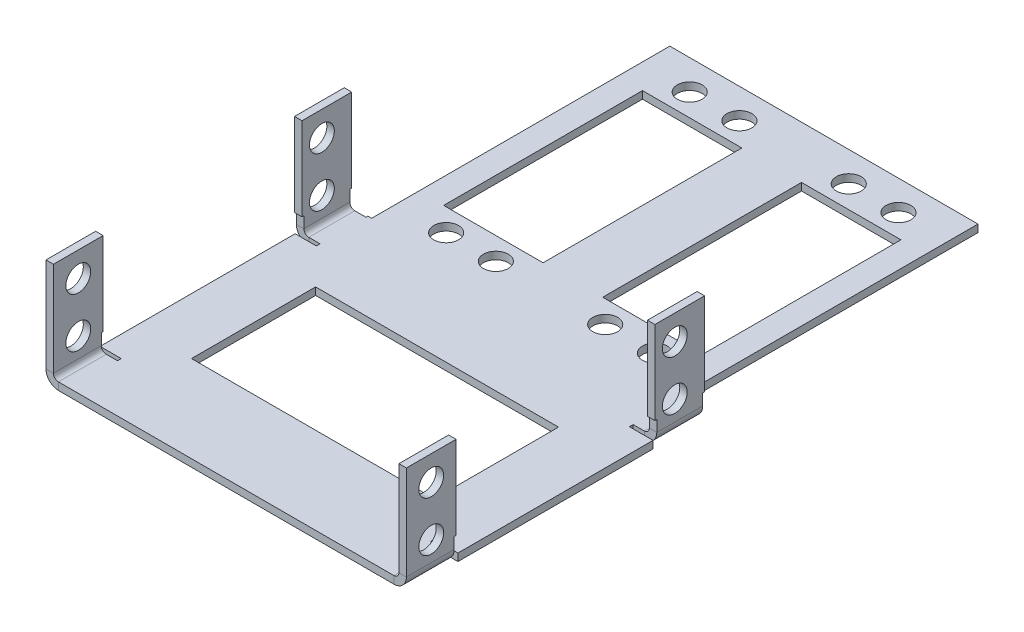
ISO-10303-21;
HEADER;
FILE_DESCRIPTION(('STEP AP214'),'2;1');
FILE_NAME('part.step','',(''),(''),'','','');
FILE_SCHEMA(('AUTOMOTIVE_DESIGN { 1 0 10303 214 1 1 1 1 }'));
ENDSEC;
DATA;
#1=APPLICATION_CONTEXT('core data for automotive mechanical design processes');
#2=APPLICATION_PROTOCOL_DEFINITION('international standard','automotive_design',2000,#1);
#3=PRODUCT_CONTEXT('',#1,'mechanical');
#4=PRODUCT('Part','Part','',(#3));
#5=PRODUCT_RELATED_PRODUCT_CATEGORY('part','',(#4));
#6=PRODUCT_DEFINITION_FORMATION('','',#4);
#7=PRODUCT_DEFINITION_CONTEXT('part definition',#1,'design');
#8=PRODUCT_DEFINITION('design','',#6,#7);
#9=PRODUCT_DEFINITION_SHAPE('','',#8);
#10=(LENGTH_UNIT() NAMED_UNIT(*) SI_UNIT(.MILLI.,.METRE.));
#11=(NAMED_UNIT(*) PLANE_ANGLE_UNIT() SI_UNIT($,.RADIAN.));
#12=(NAMED_UNIT(*) SI_UNIT($,.STERADIAN.) SOLID_ANGLE_UNIT());
#13=UNCERTAINTY_MEASURE_WITH_UNIT(LENGTH_MEASURE(1.E-05),#10,'distance_accuracy_value','');
#14=(GEOMETRIC_REPRESENTATION_CONTEXT(3) GLOBAL_UNCERTAINTY_ASSIGNED_CONTEXT((#13)) GLOBAL_UNIT_ASSIGNED_CONTEXT((#10,
#11,#12)) REPRESENTATION_CONTEXT('',''));
#15=CARTESIAN_POINT('',(0.,0.,0.));
#16=DIRECTION('',(0.,0.,1.));
#17=DIRECTION('',(1.,0.,0.));
#18=AXIS2_PLACEMENT_3D('',#15,#16,#17);
#19=CARTESIAN_POINT('',(10.,1.,-109.5));
#20=DIRECTION('',(0.,0.,1.));
#21=DIRECTION('',(-1.,0.,0.));
#22=AXIS2_PLACEMENT_3D('',#19,#20,#21);
#23=PLANE('',#22);
#24=DIRECTION('',(0.,1.,0.));
#25=VECTOR('',#24,1.);
#26=CARTESIAN_POINT('',(10.,1.,-109.5));
#27=LINE('',#26,#25);
#28=CARTESIAN_POINT('',(10.,-0.5,-109.5));
#29=VERTEX_POINT('',#28);
#30=CARTESIAN_POINT('',(10.,1.,-109.5));
#31=VERTEX_POINT('',#30);
#32=EDGE_CURVE('E1039',#29,#31,#27,.T.);
#33=ORIENTED_EDGE('',*,*,#32,.F.);
#34=DIRECTION('',(1.,0.,0.));
#35=VECTOR('',#34,1.);
#36=CARTESIAN_POINT('',(0.,-0.5,-109.5));
#37=LINE('',#36,#35);
#38=CARTESIAN_POINT('',(30.,-0.5,-109.5));
#39=VERTEX_POINT('',#38);
#40=EDGE_CURVE('E909',#39,#29,#37,.F.);
#41=ORIENTED_EDGE('',*,*,#40,.F.);
#42=DIRECTION('',(0.,1.,0.));
#43=VECTOR('',#42,1.);
#44=CARTESIAN_POINT('',(30.,1.,-109.5));
#45=LINE('',#44,#43);
#46=CARTESIAN_POINT('',(30.,1.,-109.5));
#47=VERTEX_POINT('',#46);
#48=EDGE_CURVE('E1037',#39,#47,#45,.T.);
#49=ORIENTED_EDGE('',*,*,#48,.T.);
#50=DIRECTION('',(-1.,0.,0.));
#51=VECTOR('',#50,1.);
#52=CARTESIAN_POINT('',(10.,1.,-109.5));
#53=LINE('',#52,#51);
#54=EDGE_CURVE('E489',#47,#31,#53,.T.);
#55=ORIENTED_EDGE('',*,*,#54,.T.);
#56=EDGE_LOOP('',(#33,#41,#49,#55));
#57=FACE_BOUND('',#56,.T.);
#58=ADVANCED_FACE('F37',(#57),#23,.T.);
#59=CARTESIAN_POINT('',(30.,1.,-109.5));
#60=DIRECTION('',(-1.,0.,0.));
#61=DIRECTION('',(0.,0.,-1.));
#62=AXIS2_PLACEMENT_3D('',#59,#60,#61);
#63=PLANE('',#62);
#64=ORIENTED_EDGE('',*,*,#48,.F.);
#65=DIRECTION('',(0.,0.,-1.));
#66=VECTOR('',#65,1.);
#67=CARTESIAN_POINT('',(30.,-0.5,0.));
#68=LINE('',#67,#66);
#69=CARTESIAN_POINT('',(30.,-0.5,-69.5));
#70=VERTEX_POINT('',#69);
#71=EDGE_CURVE('E742',#70,#39,#68,.T.);
#72=ORIENTED_EDGE('',*,*,#71,.F.);
#73=DIRECTION('',(0.,1.,0.));
#74=VECTOR('',#73,1.);
#75=CARTESIAN_POINT('',(30.,1.,-69.5));
#76=LINE('',#75,#74);
#77=CARTESIAN_POINT('',(30.,1.,-69.5));
#78=VERTEX_POINT('',#77);
#79=EDGE_CURVE('E1035',#70,#78,#76,.T.);
#80=ORIENTED_EDGE('',*,*,#79,.T.);
#81=DIRECTION('',(0.,0.,-1.));
#82=VECTOR('',#81,1.);
#83=CARTESIAN_POINT('',(30.,1.,-109.5));
#84=LINE('',#83,#82);
#85=EDGE_CURVE('E483',#78,#47,#84,.T.);
#86=ORIENTED_EDGE('',*,*,#85,.T.);
#87=EDGE_LOOP('',(#64,#72,#80,#86));
#88=FACE_BOUND('',#87,.T.);
#89=ADVANCED_FACE('F1162',(#88),#63,.T.);
#90=CARTESIAN_POINT('',(10.,1.,-69.5));
#91=DIRECTION('',(0.,0.,-1.));
#92=DIRECTION('',(1.,0.,0.));
#93=AXIS2_PLACEMENT_3D('',#90,#91,#92);
#94=PLANE('',#93);
#95=ORIENTED_EDGE('',*,*,#79,.F.);
#96=DIRECTION('',(1.,0.,0.));
#97=VECTOR('',#96,1.);
#98=CARTESIAN_POINT('',(0.,-0.5,-69.5));
#99=LINE('',#98,#97);
#100=CARTESIAN_POINT('',(10.,-0.5,-69.5));
#101=VERTEX_POINT('',#100);
#102=EDGE_CURVE('E898',#101,#70,#99,.T.);
#103=ORIENTED_EDGE('',*,*,#102,.F.);
#104=DIRECTION('',(0.,1.,0.));
#105=VECTOR('',#104,1.);
#106=CARTESIAN_POINT('',(10.,1.,-69.5));
#107=LINE('',#106,#105);
#108=CARTESIAN_POINT('',(10.,1.,-69.5));
#109=VERTEX_POINT('',#108);
#110=EDGE_CURVE('E1033',#101,#109,#107,.T.);
#111=ORIENTED_EDGE('',*,*,#110,.T.);
#112=DIRECTION('',(1.,0.,0.));
#113=VECTOR('',#112,1.);
#114=CARTESIAN_POINT('',(10.,1.,-69.5));
#115=LINE('',#114,#113);
#116=EDGE_CURVE('E1148',#109,#78,#115,.T.);
#117=ORIENTED_EDGE('',*,*,#116,.T.);
#118=EDGE_LOOP('',(#95,#103,#111,#117));
#119=FACE_BOUND('',#118,.T.);
#120=ADVANCED_FACE('F1166',(#119),#94,.T.);
#121=CARTESIAN_POINT('',(62.,1.,-109.5));
#122=DIRECTION('',(0.,0.,1.));
#123=DIRECTION('',(-1.,0.,0.));
#124=AXIS2_PLACEMENT_3D('',#121,#122,#123);
#125=PLANE('',#124);
#126=DIRECTION('',(0.,1.,0.));
#127=VECTOR('',#126,1.);
#128=CARTESIAN_POINT('',(42.,1.,-109.5));
#129=LINE('',#128,#127);
#130=CARTESIAN_POINT('',(42.,-0.5,-109.5));
#131=VERTEX_POINT('',#130);
#132=CARTESIAN_POINT('',(42.,1.,-109.5));
#133=VERTEX_POINT('',#132);
#134=EDGE_CURVE('E1031',#131,#133,#129,.T.);
#135=ORIENTED_EDGE('',*,*,#134,.F.);
#136=DIRECTION('',(1.,0.,0.));
#137=VECTOR('',#136,1.);
#138=CARTESIAN_POINT('',(0.,-0.5,-109.5));
#139=LINE('',#138,#137);
#140=CARTESIAN_POINT('',(62.,-0.5,-109.5));
#141=VERTEX_POINT('',#140);
#142=EDGE_CURVE('E899',#141,#131,#139,.F.);
#143=ORIENTED_EDGE('',*,*,#142,.F.);
#144=DIRECTION('',(0.,1.,0.));
#145=VECTOR('',#144,1.);
#146=CARTESIAN_POINT('',(62.,1.,-109.5));
#147=LINE('',#146,#145);
#148=CARTESIAN_POINT('',(62.,1.,-109.5));
#149=VERTEX_POINT('',#148);
#150=EDGE_CURVE('E1029',#141,#149,#147,.T.);
#151=ORIENTED_EDGE('',*,*,#150,.T.);
#152=DIRECTION('',(-1.,0.,0.));
#153=VECTOR('',#152,1.);
#154=CARTESIAN_POINT('',(62.,1.,-109.5));
#155=LINE('',#154,#153);
#156=EDGE_CURVE('E1142',#149,#133,#155,.T.);
#157=ORIENTED_EDGE('',*,*,#156,.T.);
#158=EDGE_LOOP('',(#135,#143,#151,#157));
#159=FACE_BOUND('',#158,.T.);
#160=ADVANCED_FACE('F1635',(#159),#125,.T.);
#161=CARTESIAN_POINT('',(62.,1.,-109.5));
#162=DIRECTION('',(-1.,0.,0.));
#163=DIRECTION('',(0.,0.,-1.));
#164=AXIS2_PLACEMENT_3D('',#161,#162,#163);
#165=PLANE('',#164);
#166=ORIENTED_EDGE('',*,*,#150,.F.);
#167=DIRECTION('',(0.,0.,-1.));
#168=VECTOR('',#167,1.);
#169=CARTESIAN_POINT('',(62.,-0.5,0.));
#170=LINE('',#169,#168);
#171=CARTESIAN_POINT('',(62.,-0.5,-69.5));
#172=VERTEX_POINT('',#171);
#173=EDGE_CURVE('E895',#172,#141,#170,.T.);
#174=ORIENTED_EDGE('',*,*,#173,.F.);
#175=DIRECTION('',(0.,1.,0.));
#176=VECTOR('',#175,1.);
#177=CARTESIAN_POINT('',(62.,1.,-69.5));
#178=LINE('',#177,#176);
#179=CARTESIAN_POINT('',(62.,1.,-69.5));
#180=VERTEX_POINT('',#179);
#181=EDGE_CURVE('E1027',#172,#180,#178,.T.);
#182=ORIENTED_EDGE('',*,*,#181,.T.);
#183=DIRECTION('',(0.,0.,-1.));
#184=VECTOR('',#183,1.);
#185=CARTESIAN_POINT('',(62.,1.,-109.5));
#186=LINE('',#185,#184);
#187=EDGE_CURVE('E1145',#180,#149,#186,.T.);
#188=ORIENTED_EDGE('',*,*,#187,.T.);
#189=EDGE_LOOP('',(#166,#174,#182,#188));
#190=FACE_BOUND('',#189,.T.);
#191=ADVANCED_FACE('F1631',(#190),#165,.T.);
#192=CARTESIAN_POINT('',(62.,1.,-69.5));
#193=DIRECTION('',(0.,0.,-1.));
#194=DIRECTION('',(1.,0.,0.));
#195=AXIS2_PLACEMENT_3D('',#192,#193,#194);
#196=PLANE('',#195);
#197=ORIENTED_EDGE('',*,*,#181,.F.);
#198=DIRECTION('',(1.,0.,0.));
#199=VECTOR('',#198,1.);
#200=CARTESIAN_POINT('',(0.,-0.5,-69.5));
#201=LINE('',#200,#199);
#202=CARTESIAN_POINT('',(42.,-0.5,-69.5));
#203=VERTEX_POINT('',#202);
#204=EDGE_CURVE('E891',#203,#172,#201,.T.);
#205=ORIENTED_EDGE('',*,*,#204,.F.);
#206=DIRECTION('',(0.,1.,0.));
#207=VECTOR('',#206,1.);
#208=CARTESIAN_POINT('',(42.,1.,-69.5));
#209=LINE('',#208,#207);
#210=CARTESIAN_POINT('',(42.,1.,-69.5));
#211=VERTEX_POINT('',#210);
#212=EDGE_CURVE('E1025',#203,#211,#209,.T.);
#213=ORIENTED_EDGE('',*,*,#212,.T.);
#214=DIRECTION('',(1.,0.,0.));
#215=VECTOR('',#214,1.);
#216=CARTESIAN_POINT('',(62.,1.,-69.5));
#217=LINE('',#216,#215);
#218=EDGE_CURVE('E1136',#211,#180,#217,.T.);
#219=ORIENTED_EDGE('',*,*,#218,.T.);
#220=EDGE_LOOP('',(#197,#205,#213,#219));
#221=FACE_BOUND('',#220,.T.);
#222=ADVANCED_FACE('F1595',(#221),#196,.T.);
#223=CARTESIAN_POINT('',(0.,1.,-50.375));
#224=DIRECTION('',(0.,0.,-1.));
#225=DIRECTION('',(1.,0.,0.));
#226=AXIS2_PLACEMENT_3D('',#223,#224,#225);
#227=PLANE('',#226);
#228=DIRECTION('',(0.,1.,0.));
#229=VECTOR('',#228,1.);
#230=CARTESIAN_POINT('',(2.,1.,-50.375));
#231=LINE('',#230,#229);
#232=CARTESIAN_POINT('',(2.,-0.500000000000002,-50.375));
#233=VERTEX_POINT('',#232);
#234=CARTESIAN_POINT('',(2.,1.,-50.375));
#235=VERTEX_POINT('',#234);
#236=EDGE_CURVE('E1023',#233,#235,#231,.T.);
#237=ORIENTED_EDGE('',*,*,#236,.F.);
#238=DIRECTION('',(1.,0.,0.));
#239=VECTOR('',#238,1.);
#240=CARTESIAN_POINT('',(0.,-0.5,-50.375));
#241=LINE('',#240,#239);
#242=CARTESIAN_POINT('',(4.24999999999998,-0.5,-50.375));
#243=VERTEX_POINT('',#242);
#244=EDGE_CURVE('E715',#233,#243,#241,.T.);
#245=ORIENTED_EDGE('',*,*,#244,.T.);
#246=DIRECTION('',(0.,1.,0.));
#247=VECTOR('',#246,1.);
#248=CARTESIAN_POINT('',(4.24999999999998,1.,-50.375));
#249=LINE('',#248,#247);
#250=CARTESIAN_POINT('',(4.24999999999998,1.,-50.375));
#251=VERTEX_POINT('',#250);
#252=EDGE_CURVE('E1021',#243,#251,#249,.T.);
#253=ORIENTED_EDGE('',*,*,#252,.T.);
#254=DIRECTION('',(1.,0.,0.));
#255=VECTOR('',#254,1.);
#256=CARTESIAN_POINT('',(0.,1.,-50.375));
#257=LINE('',#256,#255);
#258=EDGE_CURVE('E605',#235,#251,#257,.T.);
#259=ORIENTED_EDGE('',*,*,#258,.F.);
#260=EDGE_LOOP('',(#237,#245,#253,#259));
#261=FACE_BOUND('',#260,.T.);
#262=ADVANCED_FACE('F1443',(#261),#227,.F.);
#263=CARTESIAN_POINT('',(4.24999999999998,1.,0.));
#264=DIRECTION('',(1.,0.,0.));
#265=DIRECTION('',(0.,0.,1.));
#266=AXIS2_PLACEMENT_3D('',#263,#264,#265);
#267=PLANE('',#266);
#268=ORIENTED_EDGE('',*,*,#252,.F.);
#269=DIRECTION('',(0.,0.,-1.));
#270=VECTOR('',#269,1.);
#271=CARTESIAN_POINT('',(4.24999999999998,-0.5,0.));
#272=LINE('',#271,#270);
#273=CARTESIAN_POINT('',(4.24999999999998,-0.5,-49.625));
#274=VERTEX_POINT('',#273);
#275=EDGE_CURVE('E843',#243,#274,#272,.F.);
#276=ORIENTED_EDGE('',*,*,#275,.T.);
#277=DIRECTION('',(0.,1.,0.));
#278=VECTOR('',#277,1.);
#279=CARTESIAN_POINT('',(4.24999999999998,1.,-49.625));
#280=LINE('',#279,#278);
#281=CARTESIAN_POINT('',(4.24999999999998,1.,-49.625));
#282=VERTEX_POINT('',#281);
#283=EDGE_CURVE('E1019',#274,#282,#280,.T.);
#284=ORIENTED_EDGE('',*,*,#283,.T.);
#285=DIRECTION('',(0.,0.,1.));
#286=VECTOR('',#285,1.);
#287=CARTESIAN_POINT('',(4.24999999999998,1.,0.));
#288=LINE('',#287,#286);
#289=EDGE_CURVE('E597',#251,#282,#288,.T.);
#290=ORIENTED_EDGE('',*,*,#289,.F.);
#291=EDGE_LOOP('',(#268,#276,#284,#290));
#292=FACE_BOUND('',#291,.T.);
#293=ADVANCED_FACE('F1440',(#292),#267,.F.);
#294=CARTESIAN_POINT('',(0.,1.,-49.625));
#295=DIRECTION('',(0.,0.,1.));
#296=DIRECTION('',(-1.,0.,0.));
#297=AXIS2_PLACEMENT_3D('',#294,#295,#296);
#298=PLANE('',#297);
#299=ORIENTED_EDGE('',*,*,#283,.F.);
#300=DIRECTION('',(1.,0.,0.));
#301=VECTOR('',#300,1.);
#302=CARTESIAN_POINT('',(0.,-0.5,-49.625));
#303=LINE('',#302,#301);
#304=CARTESIAN_POINT('',(0.,-0.5,-49.625));
#305=VERTEX_POINT('',#304);
#306=EDGE_CURVE('E859',#274,#305,#303,.F.);
#307=ORIENTED_EDGE('',*,*,#306,.T.);
#308=DIRECTION('',(0.,1.,0.));
#309=VECTOR('',#308,1.);
#310=CARTESIAN_POINT('',(0.,1.,-49.625));
#311=LINE('',#310,#309);
#312=CARTESIAN_POINT('',(0.,1.,-49.625));
#313=VERTEX_POINT('',#312);
#314=EDGE_CURVE('E1017',#305,#313,#311,.T.);
#315=ORIENTED_EDGE('',*,*,#314,.T.);
#316=DIRECTION('',(-1.,0.,0.));
#317=VECTOR('',#316,1.);
#318=CARTESIAN_POINT('',(0.,1.,-49.625));
#319=LINE('',#318,#317);
#320=EDGE_CURVE('E602',#282,#313,#319,.T.);
#321=ORIENTED_EDGE('',*,*,#320,.F.);
#322=EDGE_LOOP('',(#299,#307,#315,#321));
#323=FACE_BOUND('',#322,.T.);
#324=ADVANCED_FACE('F1435',(#323),#298,.F.);
#325=CARTESIAN_POINT('',(0.,1.,0.));
#326=DIRECTION('',(1.,0.,0.));
#327=DIRECTION('',(0.,0.,1.));
#328=AXIS2_PLACEMENT_3D('',#325,#326,#327);
#329=PLANE('',#328);
#330=ORIENTED_EDGE('',*,*,#314,.F.);
#331=DIRECTION('',(0.,0.,-1.));
#332=VECTOR('',#331,1.);
#333=CARTESIAN_POINT('',(0.,-0.5,0.));
#334=LINE('',#333,#332);
#335=CARTESIAN_POINT('',(0.,-0.5,-10.375));
#336=VERTEX_POINT('',#335);
#337=EDGE_CURVE('E741',#305,#336,#334,.F.);
#338=ORIENTED_EDGE('',*,*,#337,.T.);
#339=DIRECTION('',(0.,1.,0.));
#340=VECTOR('',#339,1.);
#341=CARTESIAN_POINT('',(0.,1.,-10.375));
#342=LINE('',#341,#340);
#343=CARTESIAN_POINT('',(0.,1.,-10.375));
#344=VERTEX_POINT('',#343);
#345=EDGE_CURVE('E1015',#336,#344,#342,.T.);
#346=ORIENTED_EDGE('',*,*,#345,.T.);
#347=DIRECTION('',(0.,0.,1.));
#348=VECTOR('',#347,1.);
#349=CARTESIAN_POINT('',(0.,1.,0.));
#350=LINE('',#349,#348);
#351=EDGE_CURVE('E482',#313,#344,#350,.T.);
#352=ORIENTED_EDGE('',*,*,#351,.F.);
#353=EDGE_LOOP('',(#330,#338,#346,#352));
#354=FACE_BOUND('',#353,.T.);
#355=ADVANCED_FACE('F1431',(#354),#329,.F.);
#356=CARTESIAN_POINT('',(0.,1.,-10.375));
#357=DIRECTION('',(0.,0.,-1.));
#358=DIRECTION('',(1.,0.,0.));
#359=AXIS2_PLACEMENT_3D('',#356,#357,#358);
#360=PLANE('',#359);
#361=ORIENTED_EDGE('',*,*,#345,.F.);
#362=DIRECTION('',(1.,0.,0.));
#363=VECTOR('',#362,1.);
#364=CARTESIAN_POINT('',(0.,-0.5,-10.375));
#365=LINE('',#364,#363);
#366=CARTESIAN_POINT('',(4.24999999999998,-0.5,-10.375));
#367=VERTEX_POINT('',#366);
#368=EDGE_CURVE('E847',#336,#367,#365,.T.);
#369=ORIENTED_EDGE('',*,*,#368,.T.);
#370=DIRECTION('',(0.,1.,0.));
#371=VECTOR('',#370,1.);
#372=CARTESIAN_POINT('',(4.24999999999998,1.,-10.375));
#373=LINE('',#372,#371);
#374=CARTESIAN_POINT('',(4.24999999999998,1.,-10.375));
#375=VERTEX_POINT('',#374);
#376=EDGE_CURVE('E1013',#367,#375,#373,.T.);
#377=ORIENTED_EDGE('',*,*,#376,.T.);
#378=DIRECTION('',(1.,0.,0.));
#379=VECTOR('',#378,1.);
#380=CARTESIAN_POINT('',(0.,1.,-10.375));
#381=LINE('',#380,#379);
#382=EDGE_CURVE('E590',#344,#375,#381,.T.);
#383=ORIENTED_EDGE('',*,*,#382,.F.);
#384=EDGE_LOOP('',(#361,#369,#377,#383));
#385=FACE_BOUND('',#384,.T.);
#386=ADVANCED_FACE('F1427',(#385),#360,.F.);
#387=CARTESIAN_POINT('',(4.24999999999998,1.,0.));
#388=DIRECTION('',(1.,0.,0.));
#389=DIRECTION('',(0.,0.,1.));
#390=AXIS2_PLACEMENT_3D('',#387,#388,#389);
#391=PLANE('',#390);
#392=ORIENTED_EDGE('',*,*,#376,.F.);
#393=DIRECTION('',(0.,0.,-1.));
#394=VECTOR('',#393,1.);
#395=CARTESIAN_POINT('',(4.24999999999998,-0.5,0.));
#396=LINE('',#395,#394);
#397=CARTESIAN_POINT('',(4.24999999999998,-0.5,-9.625));
#398=VERTEX_POINT('',#397);
#399=EDGE_CURVE('E809',#367,#398,#396,.F.);
#400=ORIENTED_EDGE('',*,*,#399,.T.);
#401=DIRECTION('',(0.,1.,0.));
#402=VECTOR('',#401,1.);
#403=CARTESIAN_POINT('',(4.24999999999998,1.,-9.625));
#404=LINE('',#403,#402);
#405=CARTESIAN_POINT('',(4.24999999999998,1.,-9.625));
#406=VERTEX_POINT('',#405);
#407=EDGE_CURVE('E1011',#398,#406,#404,.T.);
#408=ORIENTED_EDGE('',*,*,#407,.T.);
#409=DIRECTION('',(0.,0.,1.));
#410=VECTOR('',#409,1.);
#411=CARTESIAN_POINT('',(4.24999999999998,1.,0.));
#412=LINE('',#411,#410);
#413=EDGE_CURVE('E584',#375,#406,#412,.T.);
#414=ORIENTED_EDGE('',*,*,#413,.F.);
#415=EDGE_LOOP('',(#392,#400,#408,#414));
#416=FACE_BOUND('',#415,.T.);
#417=ADVANCED_FACE('F1423',(#416),#391,.F.);
#418=CARTESIAN_POINT('',(0.,1.,-9.625));
#419=DIRECTION('',(0.,0.,1.));
#420=DIRECTION('',(-1.,0.,0.));
#421=AXIS2_PLACEMENT_3D('',#418,#419,#420);
#422=PLANE('',#421);
#423=ORIENTED_EDGE('',*,*,#407,.F.);
#424=DIRECTION('',(1.,0.,0.));
#425=VECTOR('',#424,1.);
#426=CARTESIAN_POINT('',(0.,-0.5,-9.625));
#427=LINE('',#426,#425);
#428=CARTESIAN_POINT('',(2.,-0.5,-9.625));
#429=VERTEX_POINT('',#428);
#430=EDGE_CURVE('E850',#398,#429,#427,.F.);
#431=ORIENTED_EDGE('',*,*,#430,.T.);
#432=DIRECTION('',(0.,1.,0.));
#433=VECTOR('',#432,1.);
#434=CARTESIAN_POINT('',(2.,1.,-9.625));
#435=LINE('',#434,#433);
#436=CARTESIAN_POINT('',(2.,1.,-9.625));
#437=VERTEX_POINT('',#436);
#438=EDGE_CURVE('E1009',#429,#437,#435,.T.);
#439=ORIENTED_EDGE('',*,*,#438,.T.);
#440=DIRECTION('',(-1.,0.,0.));
#441=VECTOR('',#440,1.);
#442=CARTESIAN_POINT('',(0.,1.,-9.625));
#443=LINE('',#442,#441);
#444=EDGE_CURVE('E587',#406,#437,#443,.T.);
#445=ORIENTED_EDGE('',*,*,#444,.F.);
#446=EDGE_LOOP('',(#423,#431,#439,#445));
#447=FACE_BOUND('',#446,.T.);
#448=ADVANCED_FACE('F1421',(#447),#422,.F.);
#449=CARTESIAN_POINT('',(2.,2.,-9.625));
#450=DIRECTION('',(0.,0.,-1.));
#451=DIRECTION('',(-1.,0.,0.));
#452=AXIS2_PLACEMENT_3D('',#449,#450,#451);
#453=PLANE('',#452);
#454=ORIENTED_EDGE('',*,*,#438,.F.);
#455=CARTESIAN_POINT('',(2.,2.,-9.625));
#456=DIRECTION('',(0.,0.,1.));
#457=DIRECTION('',(1.,0.,0.));
#458=AXIS2_PLACEMENT_3D('',#455,#456,#457);
#459=CIRCLE('',#458,2.5);
#460=CARTESIAN_POINT('',(-0.499999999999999,2.,-9.625));
#461=VERTEX_POINT('',#460);
#462=EDGE_CURVE('E830',#429,#461,#459,.F.);
#463=ORIENTED_EDGE('',*,*,#462,.T.);
#464=DIRECTION('',(1.,0.,0.));
#465=VECTOR('',#464,1.);
#466=CARTESIAN_POINT('',(1.,2.,-9.625));
#467=LINE('',#466,#465);
#468=CARTESIAN_POINT('',(1.,2.,-9.625));
#469=VERTEX_POINT('',#468);
#470=EDGE_CURVE('E1007',#461,#469,#467,.T.);
#471=ORIENTED_EDGE('',*,*,#470,.T.);
#472=CARTESIAN_POINT('',(2.,2.,-9.625));
#473=DIRECTION('',(0.,0.,1.));
#474=DIRECTION('',(1.,0.,0.));
#475=AXIS2_PLACEMENT_3D('',#472,#473,#474);
#476=CIRCLE('',#475,1.);
#477=EDGE_CURVE('E646',#437,#469,#476,.F.);
#478=ORIENTED_EDGE('',*,*,#477,.F.);
#479=EDGE_LOOP('',(#454,#463,#471,#478));
#480=FACE_BOUND('',#479,.T.);
#481=ADVANCED_FACE('F1413',(#480),#453,.T.);
#482=CARTESIAN_POINT('',(1.,21.,-9.625));
#483=DIRECTION('',(0.,0.,1.));
#484=DIRECTION('',(0.,1.,0.));
#485=AXIS2_PLACEMENT_3D('',#482,#483,#484);
#486=PLANE('',#485);
#487=ORIENTED_EDGE('',*,*,#470,.F.);
#488=DIRECTION('',(0.,1.,0.));
#489=VECTOR('',#488,1.);
#490=CARTESIAN_POINT('',(-0.499999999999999,21.,-9.625));
#491=LINE('',#490,#489);
#492=CARTESIAN_POINT('',(-0.499999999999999,4.24999999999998,-9.625));
#493=VERTEX_POINT('',#492);
#494=EDGE_CURVE('E844',#461,#493,#491,.T.);
#495=ORIENTED_EDGE('',*,*,#494,.T.);
#496=DIRECTION('',(1.,0.,0.));
#497=VECTOR('',#496,1.);
#498=CARTESIAN_POINT('',(1.,4.24999999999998,-9.625));
#499=LINE('',#498,#497);
#500=CARTESIAN_POINT('',(1.,4.24999999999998,-9.625));
#501=VERTEX_POINT('',#500);
#502=EDGE_CURVE('E1005',#493,#501,#499,.T.);
#503=ORIENTED_EDGE('',*,*,#502,.T.);
#504=DIRECTION('',(0.,1.,0.));
#505=VECTOR('',#504,1.);
#506=CARTESIAN_POINT('',(1.,21.,-9.625));
#507=LINE('',#506,#505);
#508=EDGE_CURVE('E593',#469,#501,#507,.T.);
#509=ORIENTED_EDGE('',*,*,#508,.F.);
#510=EDGE_LOOP('',(#487,#495,#503,#509));
#511=FACE_BOUND('',#510,.T.);
#512=ADVANCED_FACE('F1399',(#511),#486,.F.);
#513=CARTESIAN_POINT('',(1.,4.24999999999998,0.));
#514=DIRECTION('',(0.,1.,0.));
#515=DIRECTION('',(0.,0.,-1.));
#516=AXIS2_PLACEMENT_3D('',#513,#514,#515);
#517=PLANE('',#516);
#518=ORIENTED_EDGE('',*,*,#502,.F.);
#519=DIRECTION('',(0.,0.,1.));
#520=VECTOR('',#519,1.);
#521=CARTESIAN_POINT('',(-0.499999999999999,4.24999999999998,0.));
#522=LINE('',#521,#520);
#523=CARTESIAN_POINT('',(-0.499999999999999,4.24999999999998,-10.));
#524=VERTEX_POINT('',#523);
#525=EDGE_CURVE('E840',#493,#524,#522,.F.);
#526=ORIENTED_EDGE('',*,*,#525,.T.);
#527=DIRECTION('',(1.,0.,0.));
#528=VECTOR('',#527,1.);
#529=CARTESIAN_POINT('',(1.,4.24999999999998,-10.));
#530=LINE('',#529,#528);
#531=CARTESIAN_POINT('',(1.,4.24999999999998,-10.));
#532=VERTEX_POINT('',#531);
#533=EDGE_CURVE('E1003',#524,#532,#530,.T.);
#534=ORIENTED_EDGE('',*,*,#533,.T.);
#535=DIRECTION('',(0.,0.,-1.));
#536=VECTOR('',#535,1.);
#537=CARTESIAN_POINT('',(1.,4.24999999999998,0.));
#538=LINE('',#537,#536);
#539=EDGE_CURVE('E594',#501,#532,#538,.T.);
#540=ORIENTED_EDGE('',*,*,#539,.F.);
#541=EDGE_LOOP('',(#518,#526,#534,#540));
#542=FACE_BOUND('',#541,.T.);
#543=ADVANCED_FACE('F1396',(#542),#517,.F.);
#544=CARTESIAN_POINT('',(1.,21.,-10.));
#545=DIRECTION('',(0.,0.,-1.));
#546=DIRECTION('',(0.,-1.,0.));
#547=AXIS2_PLACEMENT_3D('',#544,#545,#546);
#548=PLANE('',#547);
#549=ORIENTED_EDGE('',*,*,#533,.F.);
#550=DIRECTION('',(0.,1.,0.));
#551=VECTOR('',#550,1.);
#552=CARTESIAN_POINT('',(-0.499999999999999,21.,-10.));
#553=LINE('',#552,#551);
#554=CARTESIAN_POINT('',(-0.499999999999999,21.,-10.));
#555=VERTEX_POINT('',#554);
#556=EDGE_CURVE('E836',#555,#524,#553,.F.);
#557=ORIENTED_EDGE('',*,*,#556,.F.);
#558=DIRECTION('',(1.,0.,0.));
#559=VECTOR('',#558,1.);
#560=CARTESIAN_POINT('',(1.,21.,-10.));
#561=LINE('',#560,#559);
#562=CARTESIAN_POINT('',(1.,21.,-10.));
#563=VERTEX_POINT('',#562);
#564=EDGE_CURVE('E1001',#555,#563,#561,.T.);
#565=ORIENTED_EDGE('',*,*,#564,.T.);
#566=DIRECTION('',(0.,-1.,0.));
#567=VECTOR('',#566,1.);
#568=CARTESIAN_POINT('',(1.,21.,-10.));
#569=LINE('',#568,#567);
#570=EDGE_CURVE('E519',#563,#532,#569,.T.);
#571=ORIENTED_EDGE('',*,*,#570,.T.);
#572=EDGE_LOOP('',(#549,#557,#565,#571));
#573=FACE_BOUND('',#572,.T.);
#574=ADVANCED_FACE('F1389',(#573),#548,.T.);
#575=CARTESIAN_POINT('',(1.,21.,0.));
#576=DIRECTION('',(0.,1.,0.));
#577=DIRECTION('',(0.,0.,-1.));
#578=AXIS2_PLACEMENT_3D('',#575,#576,#577);
#579=PLANE('',#578);
#580=ORIENTED_EDGE('',*,*,#564,.F.);
#581=DIRECTION('',(0.,0.,1.));
#582=VECTOR('',#581,1.);
#583=CARTESIAN_POINT('',(-0.499999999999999,21.,0.));
#584=LINE('',#583,#582);
#585=CARTESIAN_POINT('',(-0.499999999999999,21.,0.));
#586=VERTEX_POINT('',#585);
#587=EDGE_CURVE('E833',#586,#555,#584,.F.);
#588=ORIENTED_EDGE('',*,*,#587,.F.);
#589=DIRECTION('',(1.,0.,0.));
#590=VECTOR('',#589,1.);
#591=CARTESIAN_POINT('',(1.,21.,0.));
#592=LINE('',#591,#590);
#593=CARTESIAN_POINT('',(1.,21.,0.));
#594=VERTEX_POINT('',#593);
#595=EDGE_CURVE('E999',#586,#594,#592,.T.);
#596=ORIENTED_EDGE('',*,*,#595,.T.);
#597=DIRECTION('',(0.,0.,-1.));
#598=VECTOR('',#597,1.);
#599=CARTESIAN_POINT('',(1.,21.,0.));
#600=LINE('',#599,#598);
#601=EDGE_CURVE('E522',#594,#563,#600,.T.);
#602=ORIENTED_EDGE('',*,*,#601,.T.);
#603=EDGE_LOOP('',(#580,#588,#596,#602));
#604=FACE_BOUND('',#603,.T.);
#605=ADVANCED_FACE('F1385',(#604),#579,.T.);
#606=CARTESIAN_POINT('',(1.,21.,0.));
#607=DIRECTION('',(0.,0.,-1.));
#608=DIRECTION('',(0.,-1.,0.));
#609=AXIS2_PLACEMENT_3D('',#606,#607,#608);
#610=PLANE('',#609);
#611=ORIENTED_EDGE('',*,*,#595,.F.);
#612=DIRECTION('',(0.,1.,0.));
#613=VECTOR('',#612,1.);
#614=CARTESIAN_POINT('',(-0.499999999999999,21.,0.));
#615=LINE('',#614,#613);
#616=CARTESIAN_POINT('',(-0.499999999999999,2.,0.));
#617=VERTEX_POINT('',#616);
#618=EDGE_CURVE('E704',#586,#617,#615,.F.);
#619=ORIENTED_EDGE('',*,*,#618,.T.);
#620=DIRECTION('',(1.,0.,0.));
#621=VECTOR('',#620,1.);
#622=CARTESIAN_POINT('',(1.,2.,0.));
#623=LINE('',#622,#621);
#624=CARTESIAN_POINT('',(1.,2.,0.));
#625=VERTEX_POINT('',#624);
#626=EDGE_CURVE('E997',#617,#625,#623,.T.);
#627=ORIENTED_EDGE('',*,*,#626,.T.);
#628=DIRECTION('',(0.,-1.,0.));
#629=VECTOR('',#628,1.);
#630=CARTESIAN_POINT('',(1.,21.,0.));
#631=LINE('',#630,#629);
#632=EDGE_CURVE('E525',#594,#625,#631,.T.);
#633=ORIENTED_EDGE('',*,*,#632,.F.);
#634=EDGE_LOOP('',(#611,#619,#627,#633));
#635=FACE_BOUND('',#634,.T.);
#636=ADVANCED_FACE('F1410',(#635),#610,.F.);
#637=CARTESIAN_POINT('',(2.,2.,0.));
#638=DIRECTION('',(0.,0.,1.));
#639=DIRECTION('',(1.,0.,0.));
#640=AXIS2_PLACEMENT_3D('',#637,#638,#639);
#641=PLANE('',#640);
#642=ORIENTED_EDGE('',*,*,#626,.F.);
#643=CARTESIAN_POINT('',(2.,2.,0.));
#644=DIRECTION('',(0.,0.,1.));
#645=DIRECTION('',(1.,0.,0.));
#646=AXIS2_PLACEMENT_3D('',#643,#644,#645);
#647=CIRCLE('',#646,2.5);
#648=CARTESIAN_POINT('',(2.,-0.500000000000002,0.));
#649=VERTEX_POINT('',#648);
#650=EDGE_CURVE('E825',#617,#649,#647,.T.);
#651=ORIENTED_EDGE('',*,*,#650,.T.);
#652=DIRECTION('',(0.,1.,0.));
#653=VECTOR('',#652,1.);
#654=CARTESIAN_POINT('',(2.,1.,0.));
#655=LINE('',#654,#653);
#656=CARTESIAN_POINT('',(2.,1.,0.));
#657=VERTEX_POINT('',#656);
#658=EDGE_CURVE('E995',#649,#657,#655,.T.);
#659=ORIENTED_EDGE('',*,*,#658,.T.);
#660=CARTESIAN_POINT('',(2.,2.,0.));
#661=DIRECTION('',(0.,0.,-1.));
#662=DIRECTION('',(-1.,0.,0.));
#663=AXIS2_PLACEMENT_3D('',#660,#661,#662);
#664=CIRCLE('',#663,1.);
#665=EDGE_CURVE('E636',#625,#657,#664,.F.);
#666=ORIENTED_EDGE('',*,*,#665,.F.);
#667=EDGE_LOOP('',(#642,#651,#659,#666));
#668=FACE_BOUND('',#667,.T.);
#669=ADVANCED_FACE('F1407',(#668),#641,.T.);
#670=CARTESIAN_POINT('',(0.,1.,0.));
#671=DIRECTION('',(0.,0.,-1.));
#672=DIRECTION('',(1.,0.,0.));
#673=AXIS2_PLACEMENT_3D('',#670,#671,#672);
#674=PLANE('',#673);
#675=ORIENTED_EDGE('',*,*,#658,.F.);
#676=DIRECTION('',(1.,0.,0.));
#677=VECTOR('',#676,1.);
#678=CARTESIAN_POINT('',(0.,-0.5,0.));
#679=LINE('',#678,#677);
#680=CARTESIAN_POINT('',(69.5,-0.5,0.));
#681=VERTEX_POINT('',#680);
#682=EDGE_CURVE('E791',#649,#681,#679,.T.);
#683=ORIENTED_EDGE('',*,*,#682,.T.);
#684=DIRECTION('',(0.,1.,0.));
#685=VECTOR('',#684,1.);
#686=CARTESIAN_POINT('',(69.5,1.,0.));
#687=LINE('',#686,#685);
#688=CARTESIAN_POINT('',(69.5,1.,0.));
#689=VERTEX_POINT('',#688);
#690=EDGE_CURVE('E993',#681,#689,#687,.T.);
#691=ORIENTED_EDGE('',*,*,#690,.T.);
#692=DIRECTION('',(1.,0.,0.));
#693=VECTOR('',#692,1.);
#694=CARTESIAN_POINT('',(0.,1.,0.));
#695=LINE('',#694,#693);
#696=EDGE_CURVE('E486',#657,#689,#695,.T.);
#697=ORIENTED_EDGE('',*,*,#696,.F.);
#698=EDGE_LOOP('',(#675,#683,#691,#697));
#699=FACE_BOUND('',#698,.T.);
#700=ADVANCED_FACE('F1419',(#699),#674,.F.);
#701=CARTESIAN_POINT('',(69.5,2.,0.));
#702=DIRECTION('',(0.,0.,-1.));
#703=DIRECTION('',(-1.,0.,0.));
#704=AXIS2_PLACEMENT_3D('',#701,#702,#703);
#705=PLANE('',#704);
#706=ORIENTED_EDGE('',*,*,#690,.F.);
#707=CARTESIAN_POINT('',(69.5,2.,0.));
#708=DIRECTION('',(0.,0.,-1.));
#709=DIRECTION('',(-1.,0.,0.));
#710=AXIS2_PLACEMENT_3D('',#707,#708,#709);
#711=CIRCLE('',#710,2.5);
#712=CARTESIAN_POINT('',(72.,2.,0.));
#713=VERTEX_POINT('',#712);
#714=EDGE_CURVE('E805',#681,#713,#711,.F.);
#715=ORIENTED_EDGE('',*,*,#714,.T.);
#716=DIRECTION('',(-1.,0.,0.));
#717=VECTOR('',#716,1.);
#718=CARTESIAN_POINT('',(70.5,2.,0.));
#719=LINE('',#718,#717);
#720=CARTESIAN_POINT('',(70.5,2.,0.));
#721=VERTEX_POINT('',#720);
#722=EDGE_CURVE('E991',#713,#721,#719,.T.);
#723=ORIENTED_EDGE('',*,*,#722,.T.);
#724=CARTESIAN_POINT('',(69.5,2.,0.));
#725=DIRECTION('',(0.,0.,1.));
#726=DIRECTION('',(1.,0.,0.));
#727=AXIS2_PLACEMENT_3D('',#724,#725,#726);
#728=CIRCLE('',#727,1.);
#729=EDGE_CURVE('E632',#689,#721,#728,.T.);
#730=ORIENTED_EDGE('',*,*,#729,.F.);
#731=EDGE_LOOP('',(#706,#715,#723,#730));
#732=FACE_BOUND('',#731,.T.);
#733=ADVANCED_FACE('F1337',(#732),#705,.F.);
#734=CARTESIAN_POINT('',(70.5,21.,0.));
#735=DIRECTION('',(0.,0.,1.));
#736=DIRECTION('',(0.,-1.,0.));
#737=AXIS2_PLACEMENT_3D('',#734,#735,#736);
#738=PLANE('',#737);
#739=ORIENTED_EDGE('',*,*,#722,.F.);
#740=DIRECTION('',(0.,1.,0.));
#741=VECTOR('',#740,1.);
#742=CARTESIAN_POINT('',(72.,21.,0.));
#743=LINE('',#742,#741);
#744=CARTESIAN_POINT('',(72.,21.,0.));
#745=VERTEX_POINT('',#744);
#746=EDGE_CURVE('E819',#745,#713,#743,.F.);
#747=ORIENTED_EDGE('',*,*,#746,.F.);
#748=DIRECTION('',(-1.,0.,0.));
#749=VECTOR('',#748,1.);
#750=CARTESIAN_POINT('',(70.5,21.,0.));
#751=LINE('',#750,#749);
#752=CARTESIAN_POINT('',(70.5,21.,0.));
#753=VERTEX_POINT('',#752);
#754=EDGE_CURVE('E989',#745,#753,#751,.T.);
#755=ORIENTED_EDGE('',*,*,#754,.T.);
#756=DIRECTION('',(0.,-1.,0.));
#757=VECTOR('',#756,1.);
#758=CARTESIAN_POINT('',(70.5,21.,0.));
#759=LINE('',#758,#757);
#760=EDGE_CURVE('E504',#753,#721,#759,.T.);
#761=ORIENTED_EDGE('',*,*,#760,.T.);
#762=EDGE_LOOP('',(#739,#747,#755,#761));
#763=FACE_BOUND('',#762,.T.);
#764=ADVANCED_FACE('F1334',(#763),#738,.T.);
#765=CARTESIAN_POINT('',(70.5,21.,0.));
#766=DIRECTION('',(0.,1.,0.));
#767=DIRECTION('',(0.,0.,1.));
#768=AXIS2_PLACEMENT_3D('',#765,#766,#767);
#769=PLANE('',#768);
#770=ORIENTED_EDGE('',*,*,#754,.F.);
#771=DIRECTION('',(0.,0.,-1.));
#772=VECTOR('',#771,1.);
#773=CARTESIAN_POINT('',(72.,21.,0.));
#774=LINE('',#773,#772);
#775=CARTESIAN_POINT('',(72.,21.,-10.));
#776=VERTEX_POINT('',#775);
#777=EDGE_CURVE('E816',#776,#745,#774,.F.);
#778=ORIENTED_EDGE('',*,*,#777,.F.);
#779=DIRECTION('',(-1.,0.,0.));
#780=VECTOR('',#779,1.);
#781=CARTESIAN_POINT('',(70.5,21.,-10.));
#782=LINE('',#781,#780);
#783=CARTESIAN_POINT('',(70.5,21.,-10.));
#784=VERTEX_POINT('',#783);
#785=EDGE_CURVE('E987',#776,#784,#782,.T.);
#786=ORIENTED_EDGE('',*,*,#785,.T.);
#787=DIRECTION('',(0.,0.,1.));
#788=VECTOR('',#787,1.);
#789=CARTESIAN_POINT('',(70.5,21.,0.));
#790=LINE('',#789,#788);
#791=EDGE_CURVE('E507',#784,#753,#790,.T.);
#792=ORIENTED_EDGE('',*,*,#791,.T.);
#793=EDGE_LOOP('',(#770,#778,#786,#792));
#794=FACE_BOUND('',#793,.T.);
#795=ADVANCED_FACE('F1330',(#794),#769,.T.);
#796=CARTESIAN_POINT('',(70.5,21.,-10.));
#797=DIRECTION('',(0.,0.,1.));
#798=DIRECTION('',(0.,-1.,0.));
#799=AXIS2_PLACEMENT_3D('',#796,#797,#798);
#800=PLANE('',#799);
#801=ORIENTED_EDGE('',*,*,#785,.F.);
#802=DIRECTION('',(0.,1.,0.));
#803=VECTOR('',#802,1.);
#804=CARTESIAN_POINT('',(72.,21.,-10.));
#805=LINE('',#804,#803);
#806=CARTESIAN_POINT('',(72.,4.24999999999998,-10.));
#807=VERTEX_POINT('',#806);
#808=EDGE_CURVE('E812',#776,#807,#805,.F.);
#809=ORIENTED_EDGE('',*,*,#808,.T.);
#810=DIRECTION('',(-1.,0.,0.));
#811=VECTOR('',#810,1.);
#812=CARTESIAN_POINT('',(70.5,4.24999999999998,-10.));
#813=LINE('',#812,#811);
#814=CARTESIAN_POINT('',(70.5,4.24999999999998,-10.));
#815=VERTEX_POINT('',#814);
#816=EDGE_CURVE('E985',#807,#815,#813,.T.);
#817=ORIENTED_EDGE('',*,*,#816,.T.);
#818=DIRECTION('',(0.,-1.,0.));
#819=VECTOR('',#818,1.);
#820=CARTESIAN_POINT('',(70.5,21.,-10.));
#821=LINE('',#820,#819);
#822=EDGE_CURVE('E510',#784,#815,#821,.T.);
#823=ORIENTED_EDGE('',*,*,#822,.F.);
#824=EDGE_LOOP('',(#801,#809,#817,#823));
#825=FACE_BOUND('',#824,.T.);
#826=ADVANCED_FACE('F1324',(#825),#800,.F.);
#827=CARTESIAN_POINT('',(70.5,4.24999999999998,0.));
#828=DIRECTION('',(0.,1.,0.));
#829=DIRECTION('',(0.,0.,1.));
#830=AXIS2_PLACEMENT_3D('',#827,#828,#829);
#831=PLANE('',#830);
#832=ORIENTED_EDGE('',*,*,#816,.F.);
#833=DIRECTION('',(0.,0.,-1.));
#834=VECTOR('',#833,1.);
#835=CARTESIAN_POINT('',(72.,4.24999999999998,0.));
#836=LINE('',#835,#834);
#837=CARTESIAN_POINT('',(72.,4.24999999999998,-9.625));
#838=VERTEX_POINT('',#837);
#839=EDGE_CURVE('E800',#807,#838,#836,.F.);
#840=ORIENTED_EDGE('',*,*,#839,.T.);
#841=DIRECTION('',(-1.,0.,0.));
#842=VECTOR('',#841,1.);
#843=CARTESIAN_POINT('',(70.5,4.24999999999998,-9.625));
#844=LINE('',#843,#842);
#845=CARTESIAN_POINT('',(70.5,4.24999999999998,-9.625));
#846=VERTEX_POINT('',#845);
#847=EDGE_CURVE('E983',#838,#846,#844,.T.);
#848=ORIENTED_EDGE('',*,*,#847,.T.);
#849=DIRECTION('',(0.,0.,1.));
#850=VECTOR('',#849,1.);
#851=CARTESIAN_POINT('',(70.5,4.24999999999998,0.));
#852=LINE('',#851,#850);
#853=EDGE_CURVE('E578',#815,#846,#852,.T.);
#854=ORIENTED_EDGE('',*,*,#853,.F.);
#855=EDGE_LOOP('',(#832,#840,#848,#854));
#856=FACE_BOUND('',#855,.T.);
#857=ADVANCED_FACE('F1320',(#856),#831,.F.);
#858=CARTESIAN_POINT('',(70.5,21.,-9.625));
#859=DIRECTION('',(0.,0.,1.));
#860=DIRECTION('',(0.,-1.,0.));
#861=AXIS2_PLACEMENT_3D('',#858,#859,#860);
#862=PLANE('',#861);
#863=ORIENTED_EDGE('',*,*,#847,.F.);
#864=DIRECTION('',(0.,1.,0.));
#865=VECTOR('',#864,1.);
#866=CARTESIAN_POINT('',(72.,21.,-9.625));
#867=LINE('',#866,#865);
#868=CARTESIAN_POINT('',(72.,2.,-9.625));
#869=VERTEX_POINT('',#868);
#870=EDGE_CURVE('E806',#838,#869,#867,.F.);
#871=ORIENTED_EDGE('',*,*,#870,.T.);
#872=DIRECTION('',(-1.,0.,0.));
#873=VECTOR('',#872,1.);
#874=CARTESIAN_POINT('',(70.5,2.,-9.625));
#875=LINE('',#874,#873);
#876=CARTESIAN_POINT('',(70.5,2.,-9.625));
#877=VERTEX_POINT('',#876);
#878=EDGE_CURVE('E981',#869,#877,#875,.T.);
#879=ORIENTED_EDGE('',*,*,#878,.T.);
#880=DIRECTION('',(0.,-1.,0.));
#881=VECTOR('',#880,1.);
#882=CARTESIAN_POINT('',(70.5,21.,-9.625));
#883=LINE('',#882,#881);
#884=EDGE_CURVE('E581',#846,#877,#883,.T.);
#885=ORIENTED_EDGE('',*,*,#884,.F.);
#886=EDGE_LOOP('',(#863,#871,#879,#885));
#887=FACE_BOUND('',#886,.T.);
#888=ADVANCED_FACE('F1314',(#887),#862,.F.);
#889=CARTESIAN_POINT('',(69.5,2.,-9.625));
#890=DIRECTION('',(0.,0.,-1.));
#891=DIRECTION('',(-1.,0.,0.));
#892=AXIS2_PLACEMENT_3D('',#889,#890,#891);
#893=PLANE('',#892);
#894=ORIENTED_EDGE('',*,*,#878,.F.);
#895=CARTESIAN_POINT('',(69.5,2.,-9.625));
#896=DIRECTION('',(0.,0.,-1.));
#897=DIRECTION('',(-1.,0.,0.));
#898=AXIS2_PLACEMENT_3D('',#895,#896,#897);
#899=CIRCLE('',#898,2.5);
#900=CARTESIAN_POINT('',(69.5,-0.500000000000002,-9.625));
#901=VERTEX_POINT('',#900);
#902=EDGE_CURVE('E801',#869,#901,#899,.T.);
#903=ORIENTED_EDGE('',*,*,#902,.T.);
#904=DIRECTION('',(0.,1.,0.));
#905=VECTOR('',#904,1.);
#906=CARTESIAN_POINT('',(69.5,1.,-9.625));
#907=LINE('',#906,#905);
#908=CARTESIAN_POINT('',(69.5,1.,-9.625));
#909=VERTEX_POINT('',#908);
#910=EDGE_CURVE('E979',#901,#909,#907,.T.);
#911=ORIENTED_EDGE('',*,*,#910,.T.);
#912=CARTESIAN_POINT('',(69.5,2.,-9.625));
#913=DIRECTION('',(0.,0.,1.));
#914=DIRECTION('',(1.,0.,0.));
#915=AXIS2_PLACEMENT_3D('',#912,#913,#914);
#916=CIRCLE('',#915,1.);
#917=EDGE_CURVE('E635',#877,#909,#916,.F.);
#918=ORIENTED_EDGE('',*,*,#917,.F.);
#919=EDGE_LOOP('',(#894,#903,#911,#918));
#920=FACE_BOUND('',#919,.T.);
#921=ADVANCED_FACE('F1308',(#920),#893,.T.);
#922=CARTESIAN_POINT('',(0.,1.,-9.625));
#923=DIRECTION('',(0.,0.,1.));
#924=DIRECTION('',(-1.,0.,0.));
#925=AXIS2_PLACEMENT_3D('',#922,#923,#924);
#926=PLANE('',#925);
#927=ORIENTED_EDGE('',*,*,#910,.F.);
#928=DIRECTION('',(1.,0.,0.));
#929=VECTOR('',#928,1.);
#930=CARTESIAN_POINT('',(0.,-0.5,-9.625));
#931=LINE('',#930,#929);
#932=CARTESIAN_POINT('',(67.25,-0.5,-9.625));
#933=VERTEX_POINT('',#932);
#934=EDGE_CURVE('E795',#901,#933,#931,.F.);
#935=ORIENTED_EDGE('',*,*,#934,.T.);
#936=DIRECTION('',(0.,1.,0.));
#937=VECTOR('',#936,1.);
#938=CARTESIAN_POINT('',(67.25,1.,-9.625));
#939=LINE('',#938,#937);
#940=CARTESIAN_POINT('',(67.25,1.,-9.625));
#941=VERTEX_POINT('',#940);
#942=EDGE_CURVE('E977',#933,#941,#939,.T.);
#943=ORIENTED_EDGE('',*,*,#942,.T.);
#944=DIRECTION('',(-1.,0.,0.));
#945=VECTOR('',#944,1.);
#946=CARTESIAN_POINT('',(0.,1.,-9.625));
#947=LINE('',#946,#945);
#948=EDGE_CURVE('E575',#909,#941,#947,.T.);
#949=ORIENTED_EDGE('',*,*,#948,.F.);
#950=EDGE_LOOP('',(#927,#935,#943,#949));
#951=FACE_BOUND('',#950,.T.);
#952=ADVANCED_FACE('F1301',(#951),#926,.F.);
#953=CARTESIAN_POINT('',(67.25,1.,0.));
#954=DIRECTION('',(-1.,0.,0.));
#955=DIRECTION('',(0.,0.,-1.));
#956=AXIS2_PLACEMENT_3D('',#953,#954,#955);
#957=PLANE('',#956);
#958=ORIENTED_EDGE('',*,*,#942,.F.);
#959=DIRECTION('',(0.,0.,-1.));
#960=VECTOR('',#959,1.);
#961=CARTESIAN_POINT('',(67.25,-0.5,0.));
#962=LINE('',#961,#960);
#963=CARTESIAN_POINT('',(67.25,-0.5,-10.375));
#964=VERTEX_POINT('',#963);
#965=EDGE_CURVE('E786',#933,#964,#962,.T.);
#966=ORIENTED_EDGE('',*,*,#965,.T.);
#967=DIRECTION('',(0.,1.,0.));
#968=VECTOR('',#967,1.);
#969=CARTESIAN_POINT('',(67.25,1.,-10.375));
#970=LINE('',#969,#968);
#971=CARTESIAN_POINT('',(67.25,1.,-10.375));
#972=VERTEX_POINT('',#971);
#973=EDGE_CURVE('E975',#964,#972,#970,.T.);
#974=ORIENTED_EDGE('',*,*,#973,.T.);
#975=DIRECTION('',(0.,0.,-1.));
#976=VECTOR('',#975,1.);
#977=CARTESIAN_POINT('',(67.25,1.,0.));
#978=LINE('',#977,#976);
#979=EDGE_CURVE('E567',#941,#972,#978,.T.);
#980=ORIENTED_EDGE('',*,*,#979,.F.);
#981=EDGE_LOOP('',(#958,#966,#974,#980));
#982=FACE_BOUND('',#981,.T.);
#983=ADVANCED_FACE('F1297',(#982),#957,.F.);
#984=CARTESIAN_POINT('',(0.,1.,-10.375));
#985=DIRECTION('',(0.,0.,-1.));
#986=DIRECTION('',(1.,0.,0.));
#987=AXIS2_PLACEMENT_3D('',#984,#985,#986);
#988=PLANE('',#987);
#989=ORIENTED_EDGE('',*,*,#973,.F.);
#990=DIRECTION('',(1.,0.,0.));
#991=VECTOR('',#990,1.);
#992=CARTESIAN_POINT('',(0.,-0.5,-10.375));
#993=LINE('',#992,#991);
#994=CARTESIAN_POINT('',(72.,-0.5,-10.375));
#995=VERTEX_POINT('',#994);
#996=EDGE_CURVE('E792',#964,#995,#993,.T.);
#997=ORIENTED_EDGE('',*,*,#996,.T.);
#998=DIRECTION('',(0.,1.,0.));
#999=VECTOR('',#998,1.);
#1000=CARTESIAN_POINT('',(72.,1.,-10.375));
#1001=LINE('',#1000,#999);
#1002=CARTESIAN_POINT('',(72.,1.,-10.375));
#1003=VERTEX_POINT('',#1002);
#1004=EDGE_CURVE('E973',#995,#1003,#1001,.T.);
#1005=ORIENTED_EDGE('',*,*,#1004,.T.);
#1006=DIRECTION('',(1.,0.,0.));
#1007=VECTOR('',#1006,1.);
#1008=CARTESIAN_POINT('',(0.,1.,-10.375));
#1009=LINE('',#1008,#1007);
#1010=EDGE_CURVE('E572',#972,#1003,#1009,.T.);
#1011=ORIENTED_EDGE('',*,*,#1010,.F.);
#1012=EDGE_LOOP('',(#989,#997,#1005,#1011));
#1013=FACE_BOUND('',#1012,.T.);
#1014=ADVANCED_FACE('F1294',(#1013),#988,.F.);
#1015=CARTESIAN_POINT('',(72.,1.,0.));
#1016=DIRECTION('',(-1.,0.,0.));
#1017=DIRECTION('',(0.,0.,-1.));
#1018=AXIS2_PLACEMENT_3D('',#1015,#1016,#1017);
#1019=PLANE('',#1018);
#1020=ORIENTED_EDGE('',*,*,#1004,.F.);
#1021=DIRECTION('',(0.,0.,-1.));
#1022=VECTOR('',#1021,1.);
#1023=CARTESIAN_POINT('',(72.,-0.5,0.));
#1024=LINE('',#1023,#1022);
#1025=CARTESIAN_POINT('',(72.,-0.5,-49.625));
#1026=VERTEX_POINT('',#1025);
#1027=EDGE_CURVE('E787',#995,#1026,#1024,.T.);
#1028=ORIENTED_EDGE('',*,*,#1027,.T.);
#1029=DIRECTION('',(0.,1.,0.));
#1030=VECTOR('',#1029,1.);
#1031=CARTESIAN_POINT('',(72.,1.,-49.625));
#1032=LINE('',#1031,#1030);
#1033=CARTESIAN_POINT('',(72.,1.,-49.625));
#1034=VERTEX_POINT('',#1033);
#1035=EDGE_CURVE('E971',#1026,#1034,#1032,.T.);
#1036=ORIENTED_EDGE('',*,*,#1035,.T.);
#1037=DIRECTION('',(0.,0.,-1.));
#1038=VECTOR('',#1037,1.);
#1039=CARTESIAN_POINT('',(72.,1.,0.));
#1040=LINE('',#1039,#1038);
#1041=EDGE_CURVE('E495',#1003,#1034,#1040,.T.);
#1042=ORIENTED_EDGE('',*,*,#1041,.F.);
#1043=EDGE_LOOP('',(#1020,#1028,#1036,#1042));
#1044=FACE_BOUND('',#1043,.T.);
#1045=ADVANCED_FACE('F1289',(#1044),#1019,.F.);
#1046=CARTESIAN_POINT('',(0.,1.,-49.625));
#1047=DIRECTION('',(0.,0.,1.));
#1048=DIRECTION('',(-1.,0.,0.));
#1049=AXIS2_PLACEMENT_3D('',#1046,#1047,#1048);
#1050=PLANE('',#1049);
#1051=ORIENTED_EDGE('',*,*,#1035,.F.);
#1052=DIRECTION('',(1.,0.,0.));
#1053=VECTOR('',#1052,1.);
#1054=CARTESIAN_POINT('',(0.,-0.5,-49.625));
#1055=LINE('',#1054,#1053);
#1056=CARTESIAN_POINT('',(67.25,-0.5,-49.625));
#1057=VERTEX_POINT('',#1056);
#1058=EDGE_CURVE('E781',#1026,#1057,#1055,.F.);
#1059=ORIENTED_EDGE('',*,*,#1058,.T.);
#1060=DIRECTION('',(0.,1.,0.));
#1061=VECTOR('',#1060,1.);
#1062=CARTESIAN_POINT('',(67.25,1.,-49.625));
#1063=LINE('',#1062,#1061);
#1064=CARTESIAN_POINT('',(67.25,1.,-49.625));
#1065=VERTEX_POINT('',#1064);
#1066=EDGE_CURVE('E969',#1057,#1065,#1063,.T.);
#1067=ORIENTED_EDGE('',*,*,#1066,.T.);
#1068=DIRECTION('',(-1.,0.,0.));
#1069=VECTOR('',#1068,1.);
#1070=CARTESIAN_POINT('',(0.,1.,-49.625));
#1071=LINE('',#1070,#1069);
#1072=EDGE_CURVE('E564',#1034,#1065,#1071,.T.);
#1073=ORIENTED_EDGE('',*,*,#1072,.F.);
#1074=EDGE_LOOP('',(#1051,#1059,#1067,#1073));
#1075=FACE_BOUND('',#1074,.T.);
#1076=ADVANCED_FACE('F1285',(#1075),#1050,.F.);
#1077=CARTESIAN_POINT('',(67.25,1.,0.));
#1078=DIRECTION('',(-1.,0.,0.));
#1079=DIRECTION('',(0.,0.,-1.));
#1080=AXIS2_PLACEMENT_3D('',#1077,#1078,#1079);
#1081=PLANE('',#1080);
#1082=ORIENTED_EDGE('',*,*,#1066,.F.);
#1083=DIRECTION('',(0.,0.,-1.));
#1084=VECTOR('',#1083,1.);
#1085=CARTESIAN_POINT('',(67.25,-0.5,0.));
#1086=LINE('',#1085,#1084);
#1087=CARTESIAN_POINT('',(67.25,-0.5,-50.375));
#1088=VERTEX_POINT('',#1087);
#1089=EDGE_CURVE('E772',#1057,#1088,#1086,.T.);
#1090=ORIENTED_EDGE('',*,*,#1089,.T.);
#1091=DIRECTION('',(0.,1.,0.));
#1092=VECTOR('',#1091,1.);
#1093=CARTESIAN_POINT('',(67.25,1.,-50.375));
#1094=LINE('',#1093,#1092);
#1095=CARTESIAN_POINT('',(67.25,1.,-50.375));
#1096=VERTEX_POINT('',#1095);
#1097=EDGE_CURVE('E967',#1088,#1096,#1094,.T.);
#1098=ORIENTED_EDGE('',*,*,#1097,.T.);
#1099=DIRECTION('',(0.,0.,-1.));
#1100=VECTOR('',#1099,1.);
#1101=CARTESIAN_POINT('',(67.25,1.,0.));
#1102=LINE('',#1101,#1100);
#1103=EDGE_CURVE('E560',#1065,#1096,#1102,.T.);
#1104=ORIENTED_EDGE('',*,*,#1103,.F.);
#1105=EDGE_LOOP('',(#1082,#1090,#1098,#1104));
#1106=FACE_BOUND('',#1105,.T.);
#1107=ADVANCED_FACE('F1281',(#1106),#1081,.F.);
#1108=CARTESIAN_POINT('',(0.,1.,-50.375));
#1109=DIRECTION('',(0.,0.,-1.));
#1110=DIRECTION('',(1.,0.,0.));
#1111=AXIS2_PLACEMENT_3D('',#1108,#1109,#1110);
#1112=PLANE('',#1111);
#1113=ORIENTED_EDGE('',*,*,#1097,.F.);
#1114=DIRECTION('',(1.,0.,0.));
#1115=VECTOR('',#1114,1.);
#1116=CARTESIAN_POINT('',(0.,-0.5,-50.375));
#1117=LINE('',#1116,#1115);
#1118=CARTESIAN_POINT('',(69.5,-0.5,-50.375));
#1119=VERTEX_POINT('',#1118);
#1120=EDGE_CURVE('E778',#1088,#1119,#1117,.T.);
#1121=ORIENTED_EDGE('',*,*,#1120,.T.);
#1122=DIRECTION('',(0.,1.,0.));
#1123=VECTOR('',#1122,1.);
#1124=CARTESIAN_POINT('',(69.5,1.,-50.375));
#1125=LINE('',#1124,#1123);
#1126=CARTESIAN_POINT('',(69.5,1.,-50.375));
#1127=VERTEX_POINT('',#1126);
#1128=EDGE_CURVE('E965',#1119,#1127,#1125,.T.);
#1129=ORIENTED_EDGE('',*,*,#1128,.T.);
#1130=DIRECTION('',(1.,0.,0.));
#1131=VECTOR('',#1130,1.);
#1132=CARTESIAN_POINT('',(0.,1.,-50.375));
#1133=LINE('',#1132,#1131);
#1134=EDGE_CURVE('E563',#1096,#1127,#1133,.T.);
#1135=ORIENTED_EDGE('',*,*,#1134,.F.);
#1136=EDGE_LOOP('',(#1113,#1121,#1129,#1135));
#1137=FACE_BOUND('',#1136,.T.);
#1138=ADVANCED_FACE('F1276',(#1137),#1112,.F.);
#1139=CARTESIAN_POINT('',(69.5,2.,-50.375));
#1140=DIRECTION('',(0.,0.,1.));
#1141=DIRECTION('',(1.,0.,0.));
#1142=AXIS2_PLACEMENT_3D('',#1139,#1140,#1141);
#1143=PLANE('',#1142);
#1144=ORIENTED_EDGE('',*,*,#1128,.F.);
#1145=CARTESIAN_POINT('',(69.5,2.,-50.375));
#1146=DIRECTION('',(0.,0.,-1.));
#1147=DIRECTION('',(-1.,0.,0.));
#1148=AXIS2_PLACEMENT_3D('',#1145,#1146,#1147);
#1149=CIRCLE('',#1148,2.5);
#1150=CARTESIAN_POINT('',(72.,2.,-50.375));
#1151=VERTEX_POINT('',#1150);
#1152=EDGE_CURVE('E753',#1119,#1151,#1149,.F.);
#1153=ORIENTED_EDGE('',*,*,#1152,.T.);
#1154=DIRECTION('',(-1.,0.,0.));
#1155=VECTOR('',#1154,1.);
#1156=CARTESIAN_POINT('',(70.5,2.,-50.375));
#1157=LINE('',#1156,#1155);
#1158=CARTESIAN_POINT('',(70.5,2.,-50.375));
#1159=VERTEX_POINT('',#1158);
#1160=EDGE_CURVE('E963',#1151,#1159,#1157,.T.);
#1161=ORIENTED_EDGE('',*,*,#1160,.T.);
#1162=CARTESIAN_POINT('',(69.5,2.,-50.375));
#1163=DIRECTION('',(0.,0.,-1.));
#1164=DIRECTION('',(-1.,0.,0.));
#1165=AXIS2_PLACEMENT_3D('',#1162,#1163,#1164);
#1166=CIRCLE('',#1165,1.);
#1167=EDGE_CURVE('E670',#1127,#1159,#1166,.F.);
#1168=ORIENTED_EDGE('',*,*,#1167,.F.);
#1169=EDGE_LOOP('',(#1144,#1153,#1161,#1168));
#1170=FACE_BOUND('',#1169,.T.);
#1171=ADVANCED_FACE('F1268',(#1170),#1143,.T.);
#1172=CARTESIAN_POINT('',(70.5,21.,-50.375));
#1173=DIRECTION('',(0.,0.,-1.));
#1174=DIRECTION('',(0.,1.,0.));
#1175=AXIS2_PLACEMENT_3D('',#1172,#1173,#1174);
#1176=PLANE('',#1175);
#1177=ORIENTED_EDGE('',*,*,#1160,.F.);
#1178=DIRECTION('',(0.,1.,0.));
#1179=VECTOR('',#1178,1.);
#1180=CARTESIAN_POINT('',(72.,21.,-50.375));
#1181=LINE('',#1180,#1179);
#1182=CARTESIAN_POINT('',(72.,4.24999999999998,-50.375));
#1183=VERTEX_POINT('',#1182);
#1184=EDGE_CURVE('E750',#1151,#1183,#1181,.T.);
#1185=ORIENTED_EDGE('',*,*,#1184,.T.);
#1186=DIRECTION('',(-1.,0.,0.));
#1187=VECTOR('',#1186,1.);
#1188=CARTESIAN_POINT('',(70.5,4.24999999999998,-50.375));
#1189=LINE('',#1188,#1187);
#1190=CARTESIAN_POINT('',(70.5,4.24999999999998,-50.375));
#1191=VERTEX_POINT('',#1190);
#1192=EDGE_CURVE('E961',#1183,#1191,#1189,.T.);
#1193=ORIENTED_EDGE('',*,*,#1192,.T.);
#1194=DIRECTION('',(0.,1.,0.));
#1195=VECTOR('',#1194,1.);
#1196=CARTESIAN_POINT('',(70.5,21.,-50.375));
#1197=LINE('',#1196,#1195);
#1198=EDGE_CURVE('E554',#1159,#1191,#1197,.T.);
#1199=ORIENTED_EDGE('',*,*,#1198,.F.);
#1200=EDGE_LOOP('',(#1177,#1185,#1193,#1199));
#1201=FACE_BOUND('',#1200,.T.);
#1202=ADVANCED_FACE('F1265',(#1201),#1176,.F.);
#1203=CARTESIAN_POINT('',(70.5,4.24999999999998,-60.));
#1204=DIRECTION('',(0.,1.,0.));
#1205=DIRECTION('',(0.,0.,1.));
#1206=AXIS2_PLACEMENT_3D('',#1203,#1204,#1205);
#1207=PLANE('',#1206);
#1208=ORIENTED_EDGE('',*,*,#1192,.F.);
#1209=DIRECTION('',(0.,0.,-1.));
#1210=VECTOR('',#1209,1.);
#1211=CARTESIAN_POINT('',(72.,4.24999999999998,-60.));
#1212=LINE('',#1211,#1210);
#1213=CARTESIAN_POINT('',(72.,4.24999999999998,-50.));
#1214=VERTEX_POINT('',#1213);
#1215=EDGE_CURVE('E769',#1183,#1214,#1212,.F.);
#1216=ORIENTED_EDGE('',*,*,#1215,.T.);
#1217=DIRECTION('',(-1.,0.,0.));
#1218=VECTOR('',#1217,1.);
#1219=CARTESIAN_POINT('',(70.5,4.24999999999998,-50.));
#1220=LINE('',#1219,#1218);
#1221=CARTESIAN_POINT('',(70.5,4.24999999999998,-50.));
#1222=VERTEX_POINT('',#1221);
#1223=EDGE_CURVE('E959',#1214,#1222,#1220,.T.);
#1224=ORIENTED_EDGE('',*,*,#1223,.T.);
#1225=DIRECTION('',(0.,0.,1.));
#1226=VECTOR('',#1225,1.);
#1227=CARTESIAN_POINT('',(70.5,4.24999999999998,-60.));
#1228=LINE('',#1227,#1226);
#1229=EDGE_CURVE('E557',#1191,#1222,#1228,.T.);
#1230=ORIENTED_EDGE('',*,*,#1229,.F.);
#1231=EDGE_LOOP('',(#1208,#1216,#1224,#1230));
#1232=FACE_BOUND('',#1231,.T.);
#1233=ADVANCED_FACE('F1261',(#1232),#1207,.F.);
#1234=CARTESIAN_POINT('',(70.5,21.,-50.));
#1235=DIRECTION('',(0.,0.,1.));
#1236=DIRECTION('',(0.,-1.,0.));
#1237=AXIS2_PLACEMENT_3D('',#1234,#1235,#1236);
#1238=PLANE('',#1237);
#1239=ORIENTED_EDGE('',*,*,#1223,.F.);
#1240=DIRECTION('',(0.,1.,0.));
#1241=VECTOR('',#1240,1.);
#1242=CARTESIAN_POINT('',(72.,21.,-50.));
#1243=LINE('',#1242,#1241);
#1244=CARTESIAN_POINT('',(72.,21.,-50.));
#1245=VERTEX_POINT('',#1244);
#1246=EDGE_CURVE('E765',#1245,#1214,#1243,.F.);
#1247=ORIENTED_EDGE('',*,*,#1246,.F.);
#1248=DIRECTION('',(-1.,0.,0.));
#1249=VECTOR('',#1248,1.);
#1250=CARTESIAN_POINT('',(70.5,21.,-50.));
#1251=LINE('',#1250,#1249);
#1252=CARTESIAN_POINT('',(70.5,21.,-50.));
#1253=VERTEX_POINT('',#1252);
#1254=EDGE_CURVE('E957',#1245,#1253,#1251,.T.);
#1255=ORIENTED_EDGE('',*,*,#1254,.T.);
#1256=DIRECTION('',(0.,-1.,0.));
#1257=VECTOR('',#1256,1.);
#1258=CARTESIAN_POINT('',(70.5,21.,-50.));
#1259=LINE('',#1258,#1257);
#1260=EDGE_CURVE('E1103',#1253,#1222,#1259,.T.);
#1261=ORIENTED_EDGE('',*,*,#1260,.T.);
#1262=EDGE_LOOP('',(#1239,#1247,#1255,#1261));
#1263=FACE_BOUND('',#1262,.T.);
#1264=ADVANCED_FACE('F1258',(#1263),#1238,.T.);
#1265=CARTESIAN_POINT('',(70.5,21.,-60.));
#1266=DIRECTION('',(0.,1.,0.));
#1267=DIRECTION('',(0.,0.,1.));
#1268=AXIS2_PLACEMENT_3D('',#1265,#1266,#1267);
#1269=PLANE('',#1268);
#1270=ORIENTED_EDGE('',*,*,#1254,.F.);
#1271=DIRECTION('',(0.,0.,-1.));
#1272=VECTOR('',#1271,1.);
#1273=CARTESIAN_POINT('',(72.,21.,-60.));
#1274=LINE('',#1273,#1272);
#1275=CARTESIAN_POINT('',(72.,21.,-60.));
#1276=VERTEX_POINT('',#1275);
#1277=EDGE_CURVE('E762',#1276,#1245,#1274,.F.);
#1278=ORIENTED_EDGE('',*,*,#1277,.F.);
#1279=DIRECTION('',(-1.,0.,0.));
#1280=VECTOR('',#1279,1.);
#1281=CARTESIAN_POINT('',(70.5,21.,-60.));
#1282=LINE('',#1281,#1280);
#1283=CARTESIAN_POINT('',(70.5,21.,-60.));
#1284=VERTEX_POINT('',#1283);
#1285=EDGE_CURVE('E955',#1276,#1284,#1282,.T.);
#1286=ORIENTED_EDGE('',*,*,#1285,.T.);
#1287=DIRECTION('',(0.,0.,1.));
#1288=VECTOR('',#1287,1.);
#1289=CARTESIAN_POINT('',(70.5,21.,-60.));
#1290=LINE('',#1289,#1288);
#1291=EDGE_CURVE('E1106',#1284,#1253,#1290,.T.);
#1292=ORIENTED_EDGE('',*,*,#1291,.T.);
#1293=EDGE_LOOP('',(#1270,#1278,#1286,#1292));
#1294=FACE_BOUND('',#1293,.T.);
#1295=ADVANCED_FACE('F1253',(#1294),#1269,.T.);
#1296=CARTESIAN_POINT('',(70.5,21.,-60.));
#1297=DIRECTION('',(0.,0.,1.));
#1298=DIRECTION('',(0.,-1.,0.));
#1299=AXIS2_PLACEMENT_3D('',#1296,#1297,#1298);
#1300=PLANE('',#1299);
#1301=ORIENTED_EDGE('',*,*,#1285,.F.);
#1302=DIRECTION('',(0.,1.,0.));
#1303=VECTOR('',#1302,1.);
#1304=CARTESIAN_POINT('',(72.,21.,-60.));
#1305=LINE('',#1304,#1303);
#1306=CARTESIAN_POINT('',(72.,4.24999999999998,-60.));
#1307=VERTEX_POINT('',#1306);
#1308=EDGE_CURVE('E758',#1276,#1307,#1305,.F.);
#1309=ORIENTED_EDGE('',*,*,#1308,.T.);
#1310=DIRECTION('',(-1.,0.,0.));
#1311=VECTOR('',#1310,1.);
#1312=CARTESIAN_POINT('',(70.5,4.24999999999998,-60.));
#1313=LINE('',#1312,#1311);
#1314=CARTESIAN_POINT('',(70.5,4.24999999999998,-60.));
#1315=VERTEX_POINT('',#1314);
#1316=EDGE_CURVE('E953',#1307,#1315,#1313,.T.);
#1317=ORIENTED_EDGE('',*,*,#1316,.T.);
#1318=DIRECTION('',(0.,-1.,0.));
#1319=VECTOR('',#1318,1.);
#1320=CARTESIAN_POINT('',(70.5,21.,-60.));
#1321=LINE('',#1320,#1319);
#1322=EDGE_CURVE('E1109',#1284,#1315,#1321,.T.);
#1323=ORIENTED_EDGE('',*,*,#1322,.F.);
#1324=EDGE_LOOP('',(#1301,#1309,#1317,#1323));
#1325=FACE_BOUND('',#1324,.T.);
#1326=ADVANCED_FACE('F1246',(#1325),#1300,.F.);
#1327=CARTESIAN_POINT('',(70.5,4.24999999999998,-60.));
#1328=DIRECTION('',(0.,1.,0.));
#1329=DIRECTION('',(0.,0.,1.));
#1330=AXIS2_PLACEMENT_3D('',#1327,#1328,#1329);
#1331=PLANE('',#1330);
#1332=ORIENTED_EDGE('',*,*,#1316,.F.);
#1333=DIRECTION('',(0.,0.,-1.));
#1334=VECTOR('',#1333,1.);
#1335=CARTESIAN_POINT('',(72.,4.24999999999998,-60.));
#1336=LINE('',#1335,#1334);
#1337=CARTESIAN_POINT('',(72.,4.24999999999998,-59.625));
#1338=VERTEX_POINT('',#1337);
#1339=EDGE_CURVE('E719',#1307,#1338,#1336,.F.);
#1340=ORIENTED_EDGE('',*,*,#1339,.T.);
#1341=DIRECTION('',(-1.,0.,0.));
#1342=VECTOR('',#1341,1.);
#1343=CARTESIAN_POINT('',(70.5,4.24999999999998,-59.625));
#1344=LINE('',#1343,#1342);
#1345=CARTESIAN_POINT('',(70.5,4.24999999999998,-59.625));
#1346=VERTEX_POINT('',#1345);
#1347=EDGE_CURVE('E951',#1338,#1346,#1344,.T.);
#1348=ORIENTED_EDGE('',*,*,#1347,.T.);
#1349=DIRECTION('',(0.,0.,1.));
#1350=VECTOR('',#1349,1.);
#1351=CARTESIAN_POINT('',(70.5,4.24999999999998,-60.));
#1352=LINE('',#1351,#1350);
#1353=EDGE_CURVE('E543',#1315,#1346,#1352,.T.);
#1354=ORIENTED_EDGE('',*,*,#1353,.F.);
#1355=EDGE_LOOP('',(#1332,#1340,#1348,#1354));
#1356=FACE_BOUND('',#1355,.T.);
#1357=ADVANCED_FACE('F1242',(#1356),#1331,.F.);
#1358=CARTESIAN_POINT('',(70.5,21.,-59.625));
#1359=DIRECTION('',(0.,0.,1.));
#1360=DIRECTION('',(0.,-1.,0.));
#1361=AXIS2_PLACEMENT_3D('',#1358,#1359,#1360);
#1362=PLANE('',#1361);
#1363=ORIENTED_EDGE('',*,*,#1347,.F.);
#1364=DIRECTION('',(0.,1.,0.));
#1365=VECTOR('',#1364,1.);
#1366=CARTESIAN_POINT('',(72.,21.,-59.625));
#1367=LINE('',#1366,#1365);
#1368=CARTESIAN_POINT('',(72.,2.,-59.625));
#1369=VERTEX_POINT('',#1368);
#1370=EDGE_CURVE('E747',#1338,#1369,#1367,.F.);
#1371=ORIENTED_EDGE('',*,*,#1370,.T.);
#1372=DIRECTION('',(-1.,0.,0.));
#1373=VECTOR('',#1372,1.);
#1374=CARTESIAN_POINT('',(70.5,2.,-59.625));
#1375=LINE('',#1374,#1373);
#1376=CARTESIAN_POINT('',(70.5,2.,-59.625));
#1377=VERTEX_POINT('',#1376);
#1378=EDGE_CURVE('E949',#1369,#1377,#1375,.T.);
#1379=ORIENTED_EDGE('',*,*,#1378,.T.);
#1380=DIRECTION('',(0.,-1.,0.));
#1381=VECTOR('',#1380,1.);
#1382=CARTESIAN_POINT('',(70.5,21.,-59.625));
#1383=LINE('',#1382,#1381);
#1384=EDGE_CURVE('E546',#1346,#1377,#1383,.T.);
#1385=ORIENTED_EDGE('',*,*,#1384,.F.);
#1386=EDGE_LOOP('',(#1363,#1371,#1379,#1385));
#1387=FACE_BOUND('',#1386,.T.);
#1388=ADVANCED_FACE('F1519',(#1387),#1362,.F.);
#1389=CARTESIAN_POINT('',(69.5,2.,-59.625));
#1390=DIRECTION('',(0.,0.,-1.));
#1391=DIRECTION('',(-1.,0.,0.));
#1392=AXIS2_PLACEMENT_3D('',#1389,#1390,#1391);
#1393=PLANE('',#1392);
#1394=ORIENTED_EDGE('',*,*,#1378,.F.);
#1395=CARTESIAN_POINT('',(69.5,2.,-59.625));
#1396=DIRECTION('',(0.,0.,-1.));
#1397=DIRECTION('',(-1.,0.,0.));
#1398=AXIS2_PLACEMENT_3D('',#1395,#1396,#1397);
#1399=CIRCLE('',#1398,2.5);
#1400=CARTESIAN_POINT('',(69.5,-0.500000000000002,-59.625));
#1401=VERTEX_POINT('',#1400);
#1402=EDGE_CURVE('E735',#1369,#1401,#1399,.T.);
#1403=ORIENTED_EDGE('',*,*,#1402,.T.);
#1404=DIRECTION('',(0.,1.,0.));
#1405=VECTOR('',#1404,1.);
#1406=CARTESIAN_POINT('',(69.5,1.,-59.625));
#1407=LINE('',#1406,#1405);
#1408=CARTESIAN_POINT('',(69.5,1.,-59.625));
#1409=VERTEX_POINT('',#1408);
#1410=EDGE_CURVE('E947',#1401,#1409,#1407,.T.);
#1411=ORIENTED_EDGE('',*,*,#1410,.T.);
#1412=CARTESIAN_POINT('',(69.5,2.,-59.625));
#1413=DIRECTION('',(0.,0.,1.));
#1414=DIRECTION('',(1.,0.,0.));
#1415=AXIS2_PLACEMENT_3D('',#1412,#1413,#1414);
#1416=CIRCLE('',#1415,1.);
#1417=EDGE_CURVE('E661',#1377,#1409,#1416,.F.);
#1418=ORIENTED_EDGE('',*,*,#1417,.F.);
#1419=EDGE_LOOP('',(#1394,#1403,#1411,#1418));
#1420=FACE_BOUND('',#1419,.T.);
#1421=ADVANCED_FACE('F1515',(#1420),#1393,.T.);
#1422=CARTESIAN_POINT('',(0.,1.,-59.625));
#1423=DIRECTION('',(0.,0.,1.));
#1424=DIRECTION('',(-1.,0.,0.));
#1425=AXIS2_PLACEMENT_3D('',#1422,#1423,#1424);
#1426=PLANE('',#1425);
#1427=ORIENTED_EDGE('',*,*,#1410,.F.);
#1428=DIRECTION('',(1.,0.,0.));
#1429=VECTOR('',#1428,1.);
#1430=CARTESIAN_POINT('',(0.,-0.5,-59.625));
#1431=LINE('',#1430,#1429);
#1432=CARTESIAN_POINT('',(67.25,-0.5,-59.625));
#1433=VERTEX_POINT('',#1432);
#1434=EDGE_CURVE('E746',#1401,#1433,#1431,.F.);
#1435=ORIENTED_EDGE('',*,*,#1434,.T.);
#1436=DIRECTION('',(0.,1.,0.));
#1437=VECTOR('',#1436,1.);
#1438=CARTESIAN_POINT('',(67.25,1.,-59.625));
#1439=LINE('',#1438,#1437);
#1440=CARTESIAN_POINT('',(67.25,1.,-59.625));
#1441=VERTEX_POINT('',#1440);
#1442=EDGE_CURVE('E945',#1433,#1441,#1439,.T.);
#1443=ORIENTED_EDGE('',*,*,#1442,.T.);
#1444=DIRECTION('',(-1.,0.,0.));
#1445=VECTOR('',#1444,1.);
#1446=CARTESIAN_POINT('',(0.,1.,-59.625));
#1447=LINE('',#1446,#1445);
#1448=EDGE_CURVE('E551',#1409,#1441,#1447,.T.);
#1449=ORIENTED_EDGE('',*,*,#1448,.F.);
#1450=EDGE_LOOP('',(#1427,#1435,#1443,#1449));
#1451=FACE_BOUND('',#1450,.T.);
#1452=ADVANCED_FACE('F1511',(#1451),#1426,.F.);
#1453=CARTESIAN_POINT('',(67.25,1.,0.));
#1454=DIRECTION('',(-1.,0.,0.));
#1455=DIRECTION('',(0.,0.,-1.));
#1456=AXIS2_PLACEMENT_3D('',#1453,#1454,#1455);
#1457=PLANE('',#1456);
#1458=DIRECTION('',(0.,1.,0.));
#1459=VECTOR('',#1458,1.);
#1460=CARTESIAN_POINT('',(67.25,1.,-60.));
#1461=LINE('',#1460,#1459);
#1462=CARTESIAN_POINT('',(67.25,1.,-60.));
#1463=VERTEX_POINT('',#1462);
#1464=CARTESIAN_POINT('',(67.25,-0.5,-60.));
#1465=VERTEX_POINT('',#1464);
#1466=EDGE_CURVE('E1072',#1463,#1465,#1461,.F.);
#1467=ORIENTED_EDGE('',*,*,#1466,.F.);
#1468=DIRECTION('',(0.,0.,-1.));
#1469=VECTOR('',#1468,1.);
#1470=CARTESIAN_POINT('',(67.25,1.,0.));
#1471=LINE('',#1470,#1469);
#1472=EDGE_CURVE('E549',#1441,#1463,#1471,.T.);
#1473=ORIENTED_EDGE('',*,*,#1472,.F.);
#1474=ORIENTED_EDGE('',*,*,#1442,.F.);
#1475=DIRECTION('',(0.,0.,-1.));
#1476=VECTOR('',#1475,1.);
#1477=CARTESIAN_POINT('',(67.25,-0.5,0.));
#1478=LINE('',#1477,#1476);
#1479=EDGE_CURVE('E743',#1433,#1465,#1478,.T.);
#1480=ORIENTED_EDGE('',*,*,#1479,.T.);
#1481=EDGE_LOOP('',(#1467,#1473,#1474,#1480));
#1482=FACE_BOUND('',#1481,.T.);
#1483=ADVANCED_FACE('F1508',(#1482),#1457,.F.);
#1484=CARTESIAN_POINT('',(0.,1.,-120.));
#1485=DIRECTION('',(0.,0.,1.));
#1486=DIRECTION('',(-1.,0.,0.));
#1487=AXIS2_PLACEMENT_3D('',#1484,#1485,#1486);
#1488=PLANE('',#1487);
#1489=DIRECTION('',(0.,1.,0.));
#1490=VECTOR('',#1489,1.);
#1491=CARTESIAN_POINT('',(67.,-9.,-120.));
#1492=LINE('',#1491,#1490);
#1493=CARTESIAN_POINT('',(67.,-0.5,-120.));
#1494=VERTEX_POINT('',#1493);
#1495=CARTESIAN_POINT('',(67.,1.,-120.));
#1496=VERTEX_POINT('',#1495);
#1497=EDGE_CURVE('E459',#1494,#1496,#1492,.T.);
#1498=ORIENTED_EDGE('',*,*,#1497,.F.);
#1499=DIRECTION('',(1.,0.,0.));
#1500=VECTOR('',#1499,1.);
#1501=CARTESIAN_POINT('',(0.,-0.5,-120.));
#1502=LINE('',#1501,#1500);
#1503=CARTESIAN_POINT('',(5.,-0.5,-120.));
#1504=VERTEX_POINT('',#1503);
#1505=EDGE_CURVE('E739',#1494,#1504,#1502,.F.);
#1506=ORIENTED_EDGE('',*,*,#1505,.T.);
#1507=DIRECTION('',(0.,1.,0.));
#1508=VECTOR('',#1507,1.);
#1509=CARTESIAN_POINT('',(5.,-9.,-120.));
#1510=LINE('',#1509,#1508);
#1511=CARTESIAN_POINT('',(5.,1.,-120.));
#1512=VERTEX_POINT('',#1511);
#1513=EDGE_CURVE('E478',#1504,#1512,#1510,.T.);
#1514=ORIENTED_EDGE('',*,*,#1513,.T.);
#1515=DIRECTION('',(-1.,0.,0.));
#1516=VECTOR('',#1515,1.);
#1517=CARTESIAN_POINT('',(0.,1.,-120.));
#1518=LINE('',#1517,#1516);
#1519=EDGE_CURVE('E477',#1496,#1512,#1518,.T.);
#1520=ORIENTED_EDGE('',*,*,#1519,.F.);
#1521=EDGE_LOOP('',(#1498,#1506,#1514,#1520));
#1522=FACE_BOUND('',#1521,.T.);
#1523=ADVANCED_FACE('F481',(#1522),#1488,.F.);
#1524=CARTESIAN_POINT('',(4.24999999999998,1.,0.));
#1525=DIRECTION('',(1.,0.,0.));
#1526=DIRECTION('',(0.,0.,1.));
#1527=AXIS2_PLACEMENT_3D('',#1524,#1525,#1526);
#1528=PLANE('',#1527);
#1529=DIRECTION('',(0.,-1.,0.));
#1530=VECTOR('',#1529,1.);
#1531=CARTESIAN_POINT('',(4.24999999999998,1.,-60.));
#1532=LINE('',#1531,#1530);
#1533=CARTESIAN_POINT('',(4.24999999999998,-0.5,-60.));
#1534=VERTEX_POINT('',#1533);
#1535=CARTESIAN_POINT('',(4.24999999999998,1.,-60.));
#1536=VERTEX_POINT('',#1535);
#1537=EDGE_CURVE('E1066',#1534,#1536,#1532,.F.);
#1538=ORIENTED_EDGE('',*,*,#1537,.F.);
#1539=DIRECTION('',(0.,0.,-1.));
#1540=VECTOR('',#1539,1.);
#1541=CARTESIAN_POINT('',(4.24999999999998,-0.5,0.));
#1542=LINE('',#1541,#1540);
#1543=CARTESIAN_POINT('',(4.24999999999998,-0.5,-59.625));
#1544=VERTEX_POINT('',#1543);
#1545=EDGE_CURVE('E711',#1534,#1544,#1542,.F.);
#1546=ORIENTED_EDGE('',*,*,#1545,.T.);
#1547=DIRECTION('',(0.,1.,0.));
#1548=VECTOR('',#1547,1.);
#1549=CARTESIAN_POINT('',(4.24999999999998,1.,-59.625));
#1550=LINE('',#1549,#1548);
#1551=CARTESIAN_POINT('',(4.24999999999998,1.,-59.625));
#1552=VERTEX_POINT('',#1551);
#1553=EDGE_CURVE('E942',#1544,#1552,#1550,.T.);
#1554=ORIENTED_EDGE('',*,*,#1553,.T.);
#1555=DIRECTION('',(0.,0.,1.));
#1556=VECTOR('',#1555,1.);
#1557=CARTESIAN_POINT('',(4.24999999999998,1.,0.));
#1558=LINE('',#1557,#1556);
#1559=EDGE_CURVE('E614',#1536,#1552,#1558,.T.);
#1560=ORIENTED_EDGE('',*,*,#1559,.F.);
#1561=EDGE_LOOP('',(#1538,#1546,#1554,#1560));
#1562=FACE_BOUND('',#1561,.T.);
#1563=ADVANCED_FACE('F1070',(#1562),#1528,.F.);
#1564=CARTESIAN_POINT('',(0.,1.,-59.625));
#1565=DIRECTION('',(0.,0.,1.));
#1566=DIRECTION('',(-1.,0.,0.));
#1567=AXIS2_PLACEMENT_3D('',#1564,#1565,#1566);
#1568=PLANE('',#1567);
#1569=ORIENTED_EDGE('',*,*,#1553,.F.);
#1570=DIRECTION('',(1.,0.,0.));
#1571=VECTOR('',#1570,1.);
#1572=CARTESIAN_POINT('',(0.,-0.5,-59.625));
#1573=LINE('',#1572,#1571);
#1574=CARTESIAN_POINT('',(2.,-0.5,-59.625));
#1575=VERTEX_POINT('',#1574);
#1576=EDGE_CURVE('E730',#1544,#1575,#1573,.F.);
#1577=ORIENTED_EDGE('',*,*,#1576,.T.);
#1578=DIRECTION('',(0.,1.,0.));
#1579=VECTOR('',#1578,1.);
#1580=CARTESIAN_POINT('',(2.,1.,-59.625));
#1581=LINE('',#1580,#1579);
#1582=CARTESIAN_POINT('',(2.,1.,-59.625));
#1583=VERTEX_POINT('',#1582);
#1584=EDGE_CURVE('E940',#1575,#1583,#1581,.T.);
#1585=ORIENTED_EDGE('',*,*,#1584,.T.);
#1586=DIRECTION('',(-1.,0.,0.));
#1587=VECTOR('',#1586,1.);
#1588=CARTESIAN_POINT('',(0.,1.,-59.625));
#1589=LINE('',#1588,#1587);
#1590=EDGE_CURVE('E616',#1552,#1583,#1589,.T.);
#1591=ORIENTED_EDGE('',*,*,#1590,.F.);
#1592=EDGE_LOOP('',(#1569,#1577,#1585,#1591));
#1593=FACE_BOUND('',#1592,.T.);
#1594=ADVANCED_FACE('F1459',(#1593),#1568,.F.);
#1595=CARTESIAN_POINT('',(2.,2.,-59.625));
#1596=DIRECTION('',(0.,0.,-1.));
#1597=DIRECTION('',(-1.,0.,0.));
#1598=AXIS2_PLACEMENT_3D('',#1595,#1596,#1597);
#1599=PLANE('',#1598);
#1600=ORIENTED_EDGE('',*,*,#1584,.F.);
#1601=CARTESIAN_POINT('',(2.,2.,-59.625));
#1602=DIRECTION('',(0.,0.,1.));
#1603=DIRECTION('',(1.,0.,0.));
#1604=AXIS2_PLACEMENT_3D('',#1601,#1602,#1603);
#1605=CIRCLE('',#1604,2.5);
#1606=CARTESIAN_POINT('',(-0.499999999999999,2.,-59.625));
#1607=VERTEX_POINT('',#1606);
#1608=EDGE_CURVE('E731',#1575,#1607,#1605,.F.);
#1609=ORIENTED_EDGE('',*,*,#1608,.T.);
#1610=DIRECTION('',(1.,0.,0.));
#1611=VECTOR('',#1610,1.);
#1612=CARTESIAN_POINT('',(1.,2.,-59.625));
#1613=LINE('',#1612,#1611);
#1614=CARTESIAN_POINT('',(1.,2.,-59.625));
#1615=VERTEX_POINT('',#1614);
#1616=EDGE_CURVE('E938',#1607,#1615,#1613,.T.);
#1617=ORIENTED_EDGE('',*,*,#1616,.T.);
#1618=CARTESIAN_POINT('',(2.,2.,-59.625));
#1619=DIRECTION('',(0.,0.,1.));
#1620=DIRECTION('',(1.,0.,0.));
#1621=AXIS2_PLACEMENT_3D('',#1618,#1619,#1620);
#1622=CIRCLE('',#1621,1.);
#1623=EDGE_CURVE('E658',#1583,#1615,#1622,.F.);
#1624=ORIENTED_EDGE('',*,*,#1623,.F.);
#1625=EDGE_LOOP('',(#1600,#1609,#1617,#1624));
#1626=FACE_BOUND('',#1625,.T.);
#1627=ADVANCED_FACE('F1461',(#1626),#1599,.T.);
#1628=CARTESIAN_POINT('',(1.,21.,-59.625));
#1629=DIRECTION('',(0.,0.,1.));
#1630=DIRECTION('',(0.,1.,0.));
#1631=AXIS2_PLACEMENT_3D('',#1628,#1629,#1630);
#1632=PLANE('',#1631);
#1633=ORIENTED_EDGE('',*,*,#1616,.F.);
#1634=DIRECTION('',(0.,1.,0.));
#1635=VECTOR('',#1634,1.);
#1636=CARTESIAN_POINT('',(-0.499999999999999,21.,-59.625));
#1637=LINE('',#1636,#1635);
#1638=CARTESIAN_POINT('',(-0.499999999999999,4.24999999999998,-59.625));
#1639=VERTEX_POINT('',#1638);
#1640=EDGE_CURVE('E727',#1607,#1639,#1637,.T.);
#1641=ORIENTED_EDGE('',*,*,#1640,.T.);
#1642=DIRECTION('',(1.,0.,0.));
#1643=VECTOR('',#1642,1.);
#1644=CARTESIAN_POINT('',(1.,4.24999999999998,-59.625));
#1645=LINE('',#1644,#1643);
#1646=CARTESIAN_POINT('',(1.,4.24999999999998,-59.625));
#1647=VERTEX_POINT('',#1646);
#1648=EDGE_CURVE('E936',#1639,#1647,#1645,.T.);
#1649=ORIENTED_EDGE('',*,*,#1648,.T.);
#1650=DIRECTION('',(0.,1.,0.));
#1651=VECTOR('',#1650,1.);
#1652=CARTESIAN_POINT('',(1.,21.,-59.625));
#1653=LINE('',#1652,#1651);
#1654=EDGE_CURVE('E619',#1615,#1647,#1653,.T.);
#1655=ORIENTED_EDGE('',*,*,#1654,.F.);
#1656=EDGE_LOOP('',(#1633,#1641,#1649,#1655));
#1657=FACE_BOUND('',#1656,.T.);
#1658=ADVANCED_FACE('F1463',(#1657),#1632,.F.);
#1659=CARTESIAN_POINT('',(1.,4.24999999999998,-50.));
#1660=DIRECTION('',(0.,1.,0.));
#1661=DIRECTION('',(0.,0.,-1.));
#1662=AXIS2_PLACEMENT_3D('',#1659,#1660,#1661);
#1663=PLANE('',#1662);
#1664=ORIENTED_EDGE('',*,*,#1648,.F.);
#1665=DIRECTION('',(0.,0.,1.));
#1666=VECTOR('',#1665,1.);
#1667=CARTESIAN_POINT('',(-0.499999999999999,4.24999999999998,-50.));
#1668=LINE('',#1667,#1666);
#1669=CARTESIAN_POINT('',(-0.499999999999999,4.24999999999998,-60.));
#1670=VERTEX_POINT('',#1669);
#1671=EDGE_CURVE('E695',#1639,#1670,#1668,.F.);
#1672=ORIENTED_EDGE('',*,*,#1671,.T.);
#1673=DIRECTION('',(1.,0.,0.));
#1674=VECTOR('',#1673,1.);
#1675=CARTESIAN_POINT('',(1.,4.24999999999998,-60.));
#1676=LINE('',#1675,#1674);
#1677=CARTESIAN_POINT('',(1.,4.24999999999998,-60.));
#1678=VERTEX_POINT('',#1677);
#1679=EDGE_CURVE('E934',#1670,#1678,#1676,.T.);
#1680=ORIENTED_EDGE('',*,*,#1679,.T.);
#1681=DIRECTION('',(0.,0.,-1.));
#1682=VECTOR('',#1681,1.);
#1683=CARTESIAN_POINT('',(1.,4.24999999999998,-50.));
#1684=LINE('',#1683,#1682);
#1685=EDGE_CURVE('E620',#1647,#1678,#1684,.T.);
#1686=ORIENTED_EDGE('',*,*,#1685,.F.);
#1687=EDGE_LOOP('',(#1664,#1672,#1680,#1686));
#1688=FACE_BOUND('',#1687,.T.);
#1689=ADVANCED_FACE('F1470',(#1688),#1663,.F.);
#1690=CARTESIAN_POINT('',(1.,21.,-60.));
#1691=DIRECTION('',(0.,0.,-1.));
#1692=DIRECTION('',(0.,-1.,0.));
#1693=AXIS2_PLACEMENT_3D('',#1690,#1691,#1692);
#1694=PLANE('',#1693);
#1695=ORIENTED_EDGE('',*,*,#1679,.F.);
#1696=DIRECTION('',(0.,1.,0.));
#1697=VECTOR('',#1696,1.);
#1698=CARTESIAN_POINT('',(-0.499999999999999,21.,-60.));
#1699=LINE('',#1698,#1697);
#1700=CARTESIAN_POINT('',(-0.499999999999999,21.,-60.));
#1701=VERTEX_POINT('',#1700);
#1702=EDGE_CURVE('E707',#1701,#1670,#1699,.F.);
#1703=ORIENTED_EDGE('',*,*,#1702,.F.);
#1704=DIRECTION('',(1.,0.,0.));
#1705=VECTOR('',#1704,1.);
#1706=CARTESIAN_POINT('',(1.,21.,-60.));
#1707=LINE('',#1706,#1705);
#1708=CARTESIAN_POINT('',(1.,21.,-60.));
#1709=VERTEX_POINT('',#1708);
#1710=EDGE_CURVE('E932',#1701,#1709,#1707,.T.);
#1711=ORIENTED_EDGE('',*,*,#1710,.T.);
#1712=DIRECTION('',(0.,-1.,0.));
#1713=VECTOR('',#1712,1.);
#1714=CARTESIAN_POINT('',(1.,21.,-60.));
#1715=LINE('',#1714,#1713);
#1716=EDGE_CURVE('E534',#1709,#1678,#1715,.T.);
#1717=ORIENTED_EDGE('',*,*,#1716,.T.);
#1718=EDGE_LOOP('',(#1695,#1703,#1711,#1717));
#1719=FACE_BOUND('',#1718,.T.);
#1720=ADVANCED_FACE('F1487',(#1719),#1694,.T.);
#1721=CARTESIAN_POINT('',(1.,21.,-50.));
#1722=DIRECTION('',(0.,1.,0.));
#1723=DIRECTION('',(0.,0.,-1.));
#1724=AXIS2_PLACEMENT_3D('',#1721,#1722,#1723);
#1725=PLANE('',#1724);
#1726=ORIENTED_EDGE('',*,*,#1710,.F.);
#1727=DIRECTION('',(0.,0.,1.));
#1728=VECTOR('',#1727,1.);
#1729=CARTESIAN_POINT('',(-0.499999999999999,21.,-50.));
#1730=LINE('',#1729,#1728);
#1731=CARTESIAN_POINT('',(-0.499999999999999,21.,-50.));
#1732=VERTEX_POINT('',#1731);
#1733=EDGE_CURVE('E720',#1732,#1701,#1730,.F.);
#1734=ORIENTED_EDGE('',*,*,#1733,.F.);
#1735=DIRECTION('',(1.,0.,0.));
#1736=VECTOR('',#1735,1.);
#1737=CARTESIAN_POINT('',(1.,21.,-50.));
#1738=LINE('',#1737,#1736);
#1739=CARTESIAN_POINT('',(1.,21.,-50.));
#1740=VERTEX_POINT('',#1739);
#1741=EDGE_CURVE('E930',#1732,#1740,#1738,.T.);
#1742=ORIENTED_EDGE('',*,*,#1741,.T.);
#1743=DIRECTION('',(0.,0.,-1.));
#1744=VECTOR('',#1743,1.);
#1745=CARTESIAN_POINT('',(1.,21.,-50.));
#1746=LINE('',#1745,#1744);
#1747=EDGE_CURVE('E537',#1740,#1709,#1746,.T.);
#1748=ORIENTED_EDGE('',*,*,#1747,.T.);
#1749=EDGE_LOOP('',(#1726,#1734,#1742,#1748));
#1750=FACE_BOUND('',#1749,.T.);
#1751=ADVANCED_FACE('F1484',(#1750),#1725,.T.);
#1752=CARTESIAN_POINT('',(1.,21.,-50.));
#1753=DIRECTION('',(0.,0.,-1.));
#1754=DIRECTION('',(0.,-1.,0.));
#1755=AXIS2_PLACEMENT_3D('',#1752,#1753,#1754);
#1756=PLANE('',#1755);
#1757=ORIENTED_EDGE('',*,*,#1741,.F.);
#1758=DIRECTION('',(0.,1.,0.));
#1759=VECTOR('',#1758,1.);
#1760=CARTESIAN_POINT('',(-0.499999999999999,21.,-50.));
#1761=LINE('',#1760,#1759);
#1762=CARTESIAN_POINT('',(-0.499999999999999,4.24999999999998,-50.));
#1763=VERTEX_POINT('',#1762);
#1764=EDGE_CURVE('E716',#1732,#1763,#1761,.F.);
#1765=ORIENTED_EDGE('',*,*,#1764,.T.);
#1766=DIRECTION('',(1.,0.,0.));
#1767=VECTOR('',#1766,1.);
#1768=CARTESIAN_POINT('',(1.,4.24999999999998,-50.));
#1769=LINE('',#1768,#1767);
#1770=CARTESIAN_POINT('',(1.,4.24999999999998,-50.));
#1771=VERTEX_POINT('',#1770);
#1772=EDGE_CURVE('E928',#1763,#1771,#1769,.T.);
#1773=ORIENTED_EDGE('',*,*,#1772,.T.);
#1774=DIRECTION('',(0.,-1.,0.));
#1775=VECTOR('',#1774,1.);
#1776=CARTESIAN_POINT('',(1.,21.,-50.));
#1777=LINE('',#1776,#1775);
#1778=EDGE_CURVE('E540',#1740,#1771,#1777,.T.);
#1779=ORIENTED_EDGE('',*,*,#1778,.F.);
#1780=EDGE_LOOP('',(#1757,#1765,#1773,#1779));
#1781=FACE_BOUND('',#1780,.T.);
#1782=ADVANCED_FACE('F1481',(#1781),#1756,.F.);
#1783=CARTESIAN_POINT('',(1.,4.24999999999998,-50.));
#1784=DIRECTION('',(0.,1.,0.));
#1785=DIRECTION('',(0.,0.,-1.));
#1786=AXIS2_PLACEMENT_3D('',#1783,#1784,#1785);
#1787=PLANE('',#1786);
#1788=ORIENTED_EDGE('',*,*,#1772,.F.);
#1789=DIRECTION('',(0.,0.,1.));
#1790=VECTOR('',#1789,1.);
#1791=CARTESIAN_POINT('',(-0.499999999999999,4.24999999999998,-50.));
#1792=LINE('',#1791,#1790);
#1793=CARTESIAN_POINT('',(-0.499999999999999,4.24999999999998,-50.375));
#1794=VERTEX_POINT('',#1793);
#1795=EDGE_CURVE('E712',#1763,#1794,#1792,.F.);
#1796=ORIENTED_EDGE('',*,*,#1795,.T.);
#1797=DIRECTION('',(1.,0.,0.));
#1798=VECTOR('',#1797,1.);
#1799=CARTESIAN_POINT('',(1.,4.24999999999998,-50.375));
#1800=LINE('',#1799,#1798);
#1801=CARTESIAN_POINT('',(1.,4.24999999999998,-50.375));
#1802=VERTEX_POINT('',#1801);
#1803=EDGE_CURVE('E926',#1794,#1802,#1800,.T.);
#1804=ORIENTED_EDGE('',*,*,#1803,.T.);
#1805=DIRECTION('',(0.,0.,-1.));
#1806=VECTOR('',#1805,1.);
#1807=CARTESIAN_POINT('',(1.,4.24999999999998,-50.));
#1808=LINE('',#1807,#1806);
#1809=EDGE_CURVE('E608',#1771,#1802,#1808,.T.);
#1810=ORIENTED_EDGE('',*,*,#1809,.F.);
#1811=EDGE_LOOP('',(#1788,#1796,#1804,#1810));
#1812=FACE_BOUND('',#1811,.T.);
#1813=ADVANCED_FACE('F1225',(#1812),#1787,.F.);
#1814=CARTESIAN_POINT('',(1.,21.,-50.375));
#1815=DIRECTION('',(0.,0.,-1.));
#1816=DIRECTION('',(0.,-1.,0.));
#1817=AXIS2_PLACEMENT_3D('',#1814,#1815,#1816);
#1818=PLANE('',#1817);
#1819=ORIENTED_EDGE('',*,*,#1803,.F.);
#1820=DIRECTION('',(0.,1.,0.));
#1821=VECTOR('',#1820,1.);
#1822=CARTESIAN_POINT('',(-0.499999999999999,21.,-50.375));
#1823=LINE('',#1822,#1821);
#1824=CARTESIAN_POINT('',(-0.499999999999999,2.,-50.375));
#1825=VERTEX_POINT('',#1824);
#1826=EDGE_CURVE('E708',#1794,#1825,#1823,.F.);
#1827=ORIENTED_EDGE('',*,*,#1826,.T.);
#1828=DIRECTION('',(1.,0.,0.));
#1829=VECTOR('',#1828,1.);
#1830=CARTESIAN_POINT('',(1.,2.,-50.375));
#1831=LINE('',#1830,#1829);
#1832=CARTESIAN_POINT('',(1.,2.,-50.375));
#1833=VERTEX_POINT('',#1832);
#1834=EDGE_CURVE('E669',#1825,#1833,#1831,.T.);
#1835=ORIENTED_EDGE('',*,*,#1834,.T.);
#1836=DIRECTION('',(0.,-1.,0.));
#1837=VECTOR('',#1836,1.);
#1838=CARTESIAN_POINT('',(1.,21.,-50.375));
#1839=LINE('',#1838,#1837);
#1840=EDGE_CURVE('E611',#1802,#1833,#1839,.T.);
#1841=ORIENTED_EDGE('',*,*,#1840,.F.);
#1842=EDGE_LOOP('',(#1819,#1827,#1835,#1841));
#1843=FACE_BOUND('',#1842,.T.);
#1844=ADVANCED_FACE('F1217',(#1843),#1818,.F.);
#1845=CARTESIAN_POINT('',(70.5,16.,-54.));
#1846=DIRECTION('',(1.,0.,0.));
#1847=DIRECTION('',(0.,0.,-1.));
#1848=AXIS2_PLACEMENT_3D('',#1845,#1846,#1847);
#1849=CYLINDRICAL_SURFACE('',#1848,2.5);
#1850=CARTESIAN_POINT('',(70.5,16.,-54.));
#1851=DIRECTION('',(1.,0.,0.));
#1852=DIRECTION('',(0.,0.,-1.));
#1853=AXIS2_PLACEMENT_3D('',#1850,#1851,#1852);
#1854=CIRCLE('',#1853,2.5);
#1855=CARTESIAN_POINT('',(70.5,16.,-56.5));
#1856=VERTEX_POINT('',#1855);
#1857=EDGE_CURVE('E639',#1856,#1856,#1854,.T.);
#1858=ORIENTED_EDGE('',*,*,#1857,.F.);
#1859=EDGE_LOOP('',(#1858));
#1860=FACE_BOUND('',#1859,.T.);
#1861=CARTESIAN_POINT('',(72.,16.,-54.));
#1862=DIRECTION('',(1.,0.,0.));
#1863=DIRECTION('',(0.,0.,-1.));
#1864=AXIS2_PLACEMENT_3D('',#1861,#1862,#1863);
#1865=CIRCLE('',#1864,2.5);
#1866=CARTESIAN_POINT('',(72.,16.,-56.5));
#1867=VERTEX_POINT('',#1866);
#1868=EDGE_CURVE('E804',#1867,#1867,#1865,.T.);
#1869=ORIENTED_EDGE('',*,*,#1868,.T.);
#1870=EDGE_LOOP('',(#1869));
#1871=FACE_BOUND('',#1870,.T.);
#1872=ADVANCED_FACE('F1215',(#1860,#1871),#1849,.F.);
#1873=CARTESIAN_POINT('',(70.5,5.99999999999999,-54.));
#1874=DIRECTION('',(1.,0.,0.));
#1875=DIRECTION('',(0.,0.,-1.));
#1876=AXIS2_PLACEMENT_3D('',#1873,#1874,#1875);
#1877=CYLINDRICAL_SURFACE('',#1876,2.5);
#1878=CARTESIAN_POINT('',(70.5,5.99999999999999,-54.));
#1879=DIRECTION('',(1.,0.,0.));
#1880=DIRECTION('',(0.,0.,-1.));
#1881=AXIS2_PLACEMENT_3D('',#1878,#1879,#1880);
#1882=CIRCLE('',#1881,2.5);
#1883=CARTESIAN_POINT('',(70.5,5.99999999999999,-56.5));
#1884=VERTEX_POINT('',#1883);
#1885=EDGE_CURVE('E1100',#1884,#1884,#1882,.T.);
#1886=ORIENTED_EDGE('',*,*,#1885,.F.);
#1887=EDGE_LOOP('',(#1886));
#1888=FACE_BOUND('',#1887,.T.);
#1889=CARTESIAN_POINT('',(72.,5.99999999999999,-54.));
#1890=DIRECTION('',(1.,0.,0.));
#1891=DIRECTION('',(0.,0.,-1.));
#1892=AXIS2_PLACEMENT_3D('',#1889,#1890,#1891);
#1893=CIRCLE('',#1892,2.5);
#1894=CARTESIAN_POINT('',(72.,5.99999999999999,-56.5));
#1895=VERTEX_POINT('',#1894);
#1896=EDGE_CURVE('E768',#1895,#1895,#1893,.T.);
#1897=ORIENTED_EDGE('',*,*,#1896,.T.);
#1898=EDGE_LOOP('',(#1897));
#1899=FACE_BOUND('',#1898,.T.);
#1900=ADVANCED_FACE('F39',(#1888,#1899),#1877,.F.);
#1901=CARTESIAN_POINT('',(57.,1.,-114.));
#1902=DIRECTION('',(0.,-1.,0.));
#1903=DIRECTION('',(0.,0.,-1.));
#1904=AXIS2_PLACEMENT_3D('',#1901,#1902,#1903);
#1905=CYLINDRICAL_SURFACE('',#1904,2.50000000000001);
#1906=CARTESIAN_POINT('',(57.,1.,-114.));
#1907=DIRECTION('',(0.,1.,0.));
#1908=DIRECTION('',(0.,0.,1.));
#1909=AXIS2_PLACEMENT_3D('',#1906,#1907,#1908);
#1910=CIRCLE('',#1909,2.50000000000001);
#1911=CARTESIAN_POINT('',(57.,1.,-111.5));
#1912=VERTEX_POINT('',#1911);
#1913=EDGE_CURVE('E1112',#1912,#1912,#1910,.T.);
#1914=ORIENTED_EDGE('',*,*,#1913,.T.);
#1915=EDGE_LOOP('',(#1914));
#1916=FACE_BOUND('',#1915,.T.);
#1917=CARTESIAN_POINT('',(57.,-0.5,-114.));
#1918=DIRECTION('',(0.,1.,0.));
#1919=DIRECTION('',(0.,0.,1.));
#1920=AXIS2_PLACEMENT_3D('',#1917,#1918,#1919);
#1921=CIRCLE('',#1920,2.50000000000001);
#1922=CARTESIAN_POINT('',(57.,-0.5,-111.5));
#1923=VERTEX_POINT('',#1922);
#1924=EDGE_CURVE('E761',#1923,#1923,#1921,.T.);
#1925=ORIENTED_EDGE('',*,*,#1924,.F.);
#1926=EDGE_LOOP('',(#1925));
#1927=FACE_BOUND('',#1926,.T.);
#1928=ADVANCED_FACE('F1223',(#1916,#1927),#1905,.F.);
#1929=CARTESIAN_POINT('',(47.,1.,-114.));
#1930=DIRECTION('',(0.,-1.,0.));
#1931=DIRECTION('',(0.,0.,-1.));
#1932=AXIS2_PLACEMENT_3D('',#1929,#1930,#1931);
#1933=CYLINDRICAL_SURFACE('',#1932,2.5);
#1934=CARTESIAN_POINT('',(47.,1.,-114.));
#1935=DIRECTION('',(0.,1.,0.));
#1936=DIRECTION('',(0.,0.,1.));
#1937=AXIS2_PLACEMENT_3D('',#1934,#1935,#1936);
#1938=CIRCLE('',#1937,2.5);
#1939=CARTESIAN_POINT('',(47.,1.,-111.5));
#1940=VERTEX_POINT('',#1939);
#1941=EDGE_CURVE('E1115',#1940,#1940,#1938,.T.);
#1942=ORIENTED_EDGE('',*,*,#1941,.T.);
#1943=EDGE_LOOP('',(#1942));
#1944=FACE_BOUND('',#1943,.T.);
#1945=CARTESIAN_POINT('',(47.,-0.5,-114.));
#1946=DIRECTION('',(0.,1.,0.));
#1947=DIRECTION('',(0.,0.,1.));
#1948=AXIS2_PLACEMENT_3D('',#1945,#1946,#1947);
#1949=CIRCLE('',#1948,2.5);
#1950=CARTESIAN_POINT('',(47.,-0.5,-111.5));
#1951=VERTEX_POINT('',#1950);
#1952=EDGE_CURVE('E870',#1951,#1951,#1949,.T.);
#1953=ORIENTED_EDGE('',*,*,#1952,.F.);
#1954=EDGE_LOOP('',(#1953));
#1955=FACE_BOUND('',#1954,.T.);
#1956=ADVANCED_FACE('F1600',(#1944,#1955),#1933,.F.);
#1957=CARTESIAN_POINT('',(57.,1.,-65.));
#1958=DIRECTION('',(0.,-1.,0.));
#1959=DIRECTION('',(0.,0.,-1.));
#1960=AXIS2_PLACEMENT_3D('',#1957,#1958,#1959);
#1961=CYLINDRICAL_SURFACE('',#1960,2.50000000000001);
#1962=CARTESIAN_POINT('',(57.,1.,-65.));
#1963=DIRECTION('',(0.,1.,0.));
#1964=DIRECTION('',(0.,0.,1.));
#1965=AXIS2_PLACEMENT_3D('',#1962,#1963,#1964);
#1966=CIRCLE('',#1965,2.50000000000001);
#1967=CARTESIAN_POINT('',(57.,1.,-62.5));
#1968=VERTEX_POINT('',#1967);
#1969=EDGE_CURVE('E1118',#1968,#1968,#1966,.T.);
#1970=ORIENTED_EDGE('',*,*,#1969,.T.);
#1971=EDGE_LOOP('',(#1970));
#1972=FACE_BOUND('',#1971,.T.);
#1973=CARTESIAN_POINT('',(57.,-0.5,-65.));
#1974=DIRECTION('',(0.,1.,0.));
#1975=DIRECTION('',(0.,0.,1.));
#1976=AXIS2_PLACEMENT_3D('',#1973,#1974,#1975);
#1977=CIRCLE('',#1976,2.50000000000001);
#1978=CARTESIAN_POINT('',(57.,-0.5,-62.5));
#1979=VERTEX_POINT('',#1978);
#1980=EDGE_CURVE('E873',#1979,#1979,#1977,.T.);
#1981=ORIENTED_EDGE('',*,*,#1980,.F.);
#1982=EDGE_LOOP('',(#1981));
#1983=FACE_BOUND('',#1982,.T.);
#1984=ADVANCED_FACE('F1604',(#1972,#1983),#1961,.F.);
#1985=CARTESIAN_POINT('',(47.,1.,-65.));
#1986=DIRECTION('',(0.,-1.,0.));
#1987=DIRECTION('',(0.,0.,-1.));
#1988=AXIS2_PLACEMENT_3D('',#1985,#1986,#1987);
#1989=CYLINDRICAL_SURFACE('',#1988,2.5);
#1990=CARTESIAN_POINT('',(47.,1.,-65.));
#1991=DIRECTION('',(0.,1.,0.));
#1992=DIRECTION('',(0.,0.,1.));
#1993=AXIS2_PLACEMENT_3D('',#1990,#1991,#1992);
#1994=CIRCLE('',#1993,2.5);
#1995=CARTESIAN_POINT('',(47.,1.,-62.5));
#1996=VERTEX_POINT('',#1995);
#1997=EDGE_CURVE('E1121',#1996,#1996,#1994,.T.);
#1998=ORIENTED_EDGE('',*,*,#1997,.T.);
#1999=EDGE_LOOP('',(#1998));
#2000=FACE_BOUND('',#1999,.T.);
#2001=CARTESIAN_POINT('',(47.,-0.5,-65.));
#2002=DIRECTION('',(0.,1.,0.));
#2003=DIRECTION('',(0.,0.,1.));
#2004=AXIS2_PLACEMENT_3D('',#2001,#2002,#2003);
#2005=CIRCLE('',#2004,2.5);
#2006=CARTESIAN_POINT('',(47.,-0.5,-62.5));
#2007=VERTEX_POINT('',#2006);
#2008=EDGE_CURVE('E876',#2007,#2007,#2005,.T.);
#2009=ORIENTED_EDGE('',*,*,#2008,.F.);
#2010=EDGE_LOOP('',(#2009));
#2011=FACE_BOUND('',#2010,.T.);
#2012=ADVANCED_FACE('F1608',(#2000,#2011),#1989,.F.);
#2013=CARTESIAN_POINT('',(25.,1.,-114.));
#2014=DIRECTION('',(0.,-1.,0.));
#2015=DIRECTION('',(0.,0.,-1.));
#2016=AXIS2_PLACEMENT_3D('',#2013,#2014,#2015);
#2017=CYLINDRICAL_SURFACE('',#2016,2.5);
#2018=CARTESIAN_POINT('',(25.,1.,-114.));
#2019=DIRECTION('',(0.,1.,0.));
#2020=DIRECTION('',(0.,0.,1.));
#2021=AXIS2_PLACEMENT_3D('',#2018,#2019,#2020);
#2022=CIRCLE('',#2021,2.5);
#2023=CARTESIAN_POINT('',(25.,1.,-111.5));
#2024=VERTEX_POINT('',#2023);
#2025=EDGE_CURVE('E1124',#2024,#2024,#2022,.T.);
#2026=ORIENTED_EDGE('',*,*,#2025,.T.);
#2027=EDGE_LOOP('',(#2026));
#2028=FACE_BOUND('',#2027,.T.);
#2029=CARTESIAN_POINT('',(25.,-0.5,-114.));
#2030=DIRECTION('',(0.,1.,0.));
#2031=DIRECTION('',(0.,0.,1.));
#2032=AXIS2_PLACEMENT_3D('',#2029,#2030,#2031);
#2033=CIRCLE('',#2032,2.5);
#2034=CARTESIAN_POINT('',(25.,-0.5,-111.5));
#2035=VERTEX_POINT('',#2034);
#2036=EDGE_CURVE('E879',#2035,#2035,#2033,.T.);
#2037=ORIENTED_EDGE('',*,*,#2036,.F.);
#2038=EDGE_LOOP('',(#2037));
#2039=FACE_BOUND('',#2038,.T.);
#2040=ADVANCED_FACE('F1612',(#2028,#2039),#2017,.F.);
#2041=CARTESIAN_POINT('',(15.,1.,-114.));
#2042=DIRECTION('',(0.,-1.,0.));
#2043=DIRECTION('',(0.,0.,-1.));
#2044=AXIS2_PLACEMENT_3D('',#2041,#2042,#2043);
#2045=CYLINDRICAL_SURFACE('',#2044,2.5);
#2046=CARTESIAN_POINT('',(15.,1.,-114.));
#2047=DIRECTION('',(0.,1.,0.));
#2048=DIRECTION('',(0.,0.,1.));
#2049=AXIS2_PLACEMENT_3D('',#2046,#2047,#2048);
#2050=CIRCLE('',#2049,2.5);
#2051=CARTESIAN_POINT('',(15.,1.,-111.5));
#2052=VERTEX_POINT('',#2051);
#2053=EDGE_CURVE('E1127',#2052,#2052,#2050,.T.);
#2054=ORIENTED_EDGE('',*,*,#2053,.T.);
#2055=EDGE_LOOP('',(#2054));
#2056=FACE_BOUND('',#2055,.T.);
#2057=CARTESIAN_POINT('',(15.,-0.5,-114.));
#2058=DIRECTION('',(0.,1.,0.));
#2059=DIRECTION('',(0.,0.,1.));
#2060=AXIS2_PLACEMENT_3D('',#2057,#2058,#2059);
#2061=CIRCLE('',#2060,2.5);
#2062=CARTESIAN_POINT('',(15.,-0.5,-111.5));
#2063=VERTEX_POINT('',#2062);
#2064=EDGE_CURVE('E882',#2063,#2063,#2061,.T.);
#2065=ORIENTED_EDGE('',*,*,#2064,.F.);
#2066=EDGE_LOOP('',(#2065));
#2067=FACE_BOUND('',#2066,.T.);
#2068=ADVANCED_FACE('F1616',(#2056,#2067),#2045,.F.);
#2069=CARTESIAN_POINT('',(15.,1.,-65.));
#2070=DIRECTION('',(0.,-1.,0.));
#2071=DIRECTION('',(0.,0.,-1.));
#2072=AXIS2_PLACEMENT_3D('',#2069,#2070,#2071);
#2073=CYLINDRICAL_SURFACE('',#2072,2.5);
#2074=CARTESIAN_POINT('',(15.,1.,-65.));
#2075=DIRECTION('',(0.,1.,0.));
#2076=DIRECTION('',(0.,0.,1.));
#2077=AXIS2_PLACEMENT_3D('',#2074,#2075,#2076);
#2078=CIRCLE('',#2077,2.5);
#2079=CARTESIAN_POINT('',(15.,1.,-62.5));
#2080=VERTEX_POINT('',#2079);
#2081=EDGE_CURVE('E1130',#2080,#2080,#2078,.T.);
#2082=ORIENTED_EDGE('',*,*,#2081,.T.);
#2083=EDGE_LOOP('',(#2082));
#2084=FACE_BOUND('',#2083,.T.);
#2085=CARTESIAN_POINT('',(15.,-0.5,-65.));
#2086=DIRECTION('',(0.,1.,0.));
#2087=DIRECTION('',(0.,0.,1.));
#2088=AXIS2_PLACEMENT_3D('',#2085,#2086,#2087);
#2089=CIRCLE('',#2088,2.5);
#2090=CARTESIAN_POINT('',(15.,-0.5,-62.5));
#2091=VERTEX_POINT('',#2090);
#2092=EDGE_CURVE('E885',#2091,#2091,#2089,.T.);
#2093=ORIENTED_EDGE('',*,*,#2092,.F.);
#2094=EDGE_LOOP('',(#2093));
#2095=FACE_BOUND('',#2094,.T.);
#2096=ADVANCED_FACE('F1620',(#2084,#2095),#2073,.F.);
#2097=CARTESIAN_POINT('',(25.,1.,-65.));
#2098=DIRECTION('',(0.,-1.,0.));
#2099=DIRECTION('',(0.,0.,-1.));
#2100=AXIS2_PLACEMENT_3D('',#2097,#2098,#2099);
#2101=CYLINDRICAL_SURFACE('',#2100,2.5);
#2102=CARTESIAN_POINT('',(25.,1.,-65.));
#2103=DIRECTION('',(0.,1.,0.));
#2104=DIRECTION('',(0.,0.,1.));
#2105=AXIS2_PLACEMENT_3D('',#2102,#2103,#2104);
#2106=CIRCLE('',#2105,2.5);
#2107=CARTESIAN_POINT('',(25.,1.,-62.5));
#2108=VERTEX_POINT('',#2107);
#2109=EDGE_CURVE('E1133',#2108,#2108,#2106,.T.);
#2110=ORIENTED_EDGE('',*,*,#2109,.T.);
#2111=EDGE_LOOP('',(#2110));
#2112=FACE_BOUND('',#2111,.T.);
#2113=CARTESIAN_POINT('',(25.,-0.5,-65.));
#2114=DIRECTION('',(0.,1.,0.));
#2115=DIRECTION('',(0.,0.,1.));
#2116=AXIS2_PLACEMENT_3D('',#2113,#2114,#2115);
#2117=CIRCLE('',#2116,2.5);
#2118=CARTESIAN_POINT('',(25.,-0.5,-62.5));
#2119=VERTEX_POINT('',#2118);
#2120=EDGE_CURVE('E888',#2119,#2119,#2117,.T.);
#2121=ORIENTED_EDGE('',*,*,#2120,.F.);
#2122=EDGE_LOOP('',(#2121));
#2123=FACE_BOUND('',#2122,.T.);
#2124=ADVANCED_FACE('F1624',(#2112,#2123),#2101,.F.);
#2125=CARTESIAN_POINT('',(42.,1.,-109.5));
#2126=DIRECTION('',(1.,0.,0.));
#2127=DIRECTION('',(0.,0.,1.));
#2128=AXIS2_PLACEMENT_3D('',#2125,#2126,#2127);
#2129=PLANE('',#2128);
#2130=DIRECTION('',(0.,0.,-1.));
#2131=VECTOR('',#2130,1.);
#2132=CARTESIAN_POINT('',(42.,-0.5,0.));
#2133=LINE('',#2132,#2131);
#2134=EDGE_CURVE('E894',#131,#203,#2133,.F.);
#2135=ORIENTED_EDGE('',*,*,#2134,.F.);
#2136=ORIENTED_EDGE('',*,*,#134,.T.);
#2137=DIRECTION('',(0.,0.,1.));
#2138=VECTOR('',#2137,1.);
#2139=CARTESIAN_POINT('',(42.,1.,-109.5));
#2140=LINE('',#2139,#2138);
#2141=EDGE_CURVE('E1139',#133,#211,#2140,.T.);
#2142=ORIENTED_EDGE('',*,*,#2141,.T.);
#2143=ORIENTED_EDGE('',*,*,#212,.F.);
#2144=EDGE_LOOP('',(#2135,#2136,#2142,#2143));
#2145=FACE_BOUND('',#2144,.T.);
#2146=ADVANCED_FACE('F1199',(#2145),#2129,.T.);
#2147=CARTESIAN_POINT('',(10.,1.,-109.5));
#2148=DIRECTION('',(1.,0.,0.));
#2149=DIRECTION('',(0.,0.,1.));
#2150=AXIS2_PLACEMENT_3D('',#2147,#2148,#2149);
#2151=PLANE('',#2150);
#2152=DIRECTION('',(0.,0.,-1.));
#2153=VECTOR('',#2152,1.);
#2154=CARTESIAN_POINT('',(10.,-0.5,0.));
#2155=LINE('',#2154,#2153);
#2156=EDGE_CURVE('E906',#29,#101,#2155,.F.);
#2157=ORIENTED_EDGE('',*,*,#2156,.F.);
#2158=ORIENTED_EDGE('',*,*,#32,.T.);
#2159=DIRECTION('',(0.,0.,1.));
#2160=VECTOR('',#2159,1.);
#2161=CARTESIAN_POINT('',(10.,1.,-109.5));
#2162=LINE('',#2161,#2160);
#2163=EDGE_CURVE('E1151',#31,#109,#2162,.T.);
#2164=ORIENTED_EDGE('',*,*,#2163,.T.);
#2165=ORIENTED_EDGE('',*,*,#110,.F.);
#2166=EDGE_LOOP('',(#2157,#2158,#2164,#2165));
#2167=FACE_BOUND('',#2166,.T.);
#2168=ADVANCED_FACE('F1169',(#2167),#2151,.T.);
#2169=CARTESIAN_POINT('',(70.5,16.,-5.));
#2170=DIRECTION('',(1.,0.,0.));
#2171=DIRECTION('',(0.,0.,-1.));
#2172=AXIS2_PLACEMENT_3D('',#2169,#2170,#2171);
#2173=CYLINDRICAL_SURFACE('',#2172,2.5);
#2174=CARTESIAN_POINT('',(70.5,16.,-5.));
#2175=DIRECTION('',(1.,0.,0.));
#2176=DIRECTION('',(0.,0.,-1.));
#2177=AXIS2_PLACEMENT_3D('',#2174,#2175,#2176);
#2178=CIRCLE('',#2177,2.5);
#2179=CARTESIAN_POINT('',(70.5,16.,-7.5));
#2180=VERTEX_POINT('',#2179);
#2181=EDGE_CURVE('E498',#2180,#2180,#2178,.T.);
#2182=ORIENTED_EDGE('',*,*,#2181,.F.);
#2183=EDGE_LOOP('',(#2182));
#2184=FACE_BOUND('',#2183,.T.);
#2185=CARTESIAN_POINT('',(72.,16.,-5.));
#2186=DIRECTION('',(1.,0.,0.));
#2187=DIRECTION('',(0.,0.,-1.));
#2188=AXIS2_PLACEMENT_3D('',#2185,#2186,#2187);
#2189=CIRCLE('',#2188,2.5);
#2190=CARTESIAN_POINT('',(72.,16.,-7.5));
#2191=VERTEX_POINT('',#2190);
#2192=EDGE_CURVE('E790',#2191,#2191,#2189,.T.);
#2193=ORIENTED_EDGE('',*,*,#2192,.T.);
#2194=EDGE_LOOP('',(#2193));
#2195=FACE_BOUND('',#2194,.T.);
#2196=ADVANCED_FACE('F1198',(#2184,#2195),#2173,.F.);
#2197=CARTESIAN_POINT('',(70.5,5.99999999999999,-5.));
#2198=DIRECTION('',(1.,0.,0.));
#2199=DIRECTION('',(0.,0.,-1.));
#2200=AXIS2_PLACEMENT_3D('',#2197,#2198,#2199);
#2201=CYLINDRICAL_SURFACE('',#2200,2.5);
#2202=CARTESIAN_POINT('',(70.5,5.99999999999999,-5.));
#2203=DIRECTION('',(1.,0.,0.));
#2204=DIRECTION('',(0.,0.,-1.));
#2205=AXIS2_PLACEMENT_3D('',#2202,#2203,#2204);
#2206=CIRCLE('',#2205,2.5);
#2207=CARTESIAN_POINT('',(70.5,5.99999999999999,-7.5));
#2208=VERTEX_POINT('',#2207);
#2209=EDGE_CURVE('E501',#2208,#2208,#2206,.T.);
#2210=ORIENTED_EDGE('',*,*,#2209,.F.);
#2211=EDGE_LOOP('',(#2210));
#2212=FACE_BOUND('',#2211,.T.);
#2213=CARTESIAN_POINT('',(72.,5.99999999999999,-5.));
#2214=DIRECTION('',(1.,0.,0.));
#2215=DIRECTION('',(0.,0.,-1.));
#2216=AXIS2_PLACEMENT_3D('',#2213,#2214,#2215);
#2217=CIRCLE('',#2216,2.5);
#2218=CARTESIAN_POINT('',(72.,5.99999999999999,-7.5));
#2219=VERTEX_POINT('',#2218);
#2220=EDGE_CURVE('E822',#2219,#2219,#2217,.T.);
#2221=ORIENTED_EDGE('',*,*,#2220,.T.);
#2222=EDGE_LOOP('',(#2221));
#2223=FACE_BOUND('',#2222,.T.);
#2224=ADVANCED_FACE('F1202',(#2212,#2223),#2201,.F.);
#2225=CARTESIAN_POINT('',(1.,16.,-5.));
#2226=DIRECTION('',(-1.,0.,0.));
#2227=DIRECTION('',(0.,0.,1.));
#2228=AXIS2_PLACEMENT_3D('',#2225,#2226,#2227);
#2229=CYLINDRICAL_SURFACE('',#2228,2.5);
#2230=CARTESIAN_POINT('',(1.,16.,-5.));
#2231=DIRECTION('',(-1.,0.,0.));
#2232=DIRECTION('',(0.,0.,1.));
#2233=AXIS2_PLACEMENT_3D('',#2230,#2231,#2232);
#2234=CIRCLE('',#2233,2.5);
#2235=CARTESIAN_POINT('',(1.,16.,-2.5));
#2236=VERTEX_POINT('',#2235);
#2237=EDGE_CURVE('E513',#2236,#2236,#2234,.T.);
#2238=ORIENTED_EDGE('',*,*,#2237,.F.);
#2239=EDGE_LOOP('',(#2238));
#2240=FACE_BOUND('',#2239,.T.);
#2241=CARTESIAN_POINT('',(-0.499999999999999,16.,-5.));
#2242=DIRECTION('',(-1.,0.,0.));
#2243=DIRECTION('',(0.,0.,1.));
#2244=AXIS2_PLACEMENT_3D('',#2241,#2242,#2243);
#2245=CIRCLE('',#2244,2.5);
#2246=CARTESIAN_POINT('',(-0.499999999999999,16.,-2.5));
#2247=VERTEX_POINT('',#2246);
#2248=EDGE_CURVE('E815',#2247,#2247,#2245,.T.);
#2249=ORIENTED_EDGE('',*,*,#2248,.T.);
#2250=EDGE_LOOP('',(#2249));
#2251=FACE_BOUND('',#2250,.T.);
#2252=ADVANCED_FACE('F1206',(#2240,#2251),#2229,.F.);
#2253=CARTESIAN_POINT('',(1.,5.99999999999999,-5.));
#2254=DIRECTION('',(-1.,0.,0.));
#2255=DIRECTION('',(0.,0.,1.));
#2256=AXIS2_PLACEMENT_3D('',#2253,#2254,#2255);
#2257=CYLINDRICAL_SURFACE('',#2256,2.5);
#2258=CARTESIAN_POINT('',(1.,5.99999999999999,-5.));
#2259=DIRECTION('',(-1.,0.,0.));
#2260=DIRECTION('',(0.,0.,1.));
#2261=AXIS2_PLACEMENT_3D('',#2258,#2259,#2260);
#2262=CIRCLE('',#2261,2.5);
#2263=CARTESIAN_POINT('',(1.,5.99999999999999,-2.5));
#2264=VERTEX_POINT('',#2263);
#2265=EDGE_CURVE('E516',#2264,#2264,#2262,.T.);
#2266=ORIENTED_EDGE('',*,*,#2265,.F.);
#2267=EDGE_LOOP('',(#2266));
#2268=FACE_BOUND('',#2267,.T.);
#2269=CARTESIAN_POINT('',(-0.499999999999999,5.99999999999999,-5.));
#2270=DIRECTION('',(-1.,0.,0.));
#2271=DIRECTION('',(0.,0.,1.));
#2272=AXIS2_PLACEMENT_3D('',#2269,#2270,#2271);
#2273=CIRCLE('',#2272,2.5);
#2274=CARTESIAN_POINT('',(-0.499999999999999,5.99999999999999,-2.5));
#2275=VERTEX_POINT('',#2274);
#2276=EDGE_CURVE('E839',#2275,#2275,#2273,.T.);
#2277=ORIENTED_EDGE('',*,*,#2276,.T.);
#2278=EDGE_LOOP('',(#2277));
#2279=FACE_BOUND('',#2278,.T.);
#2280=ADVANCED_FACE('F1210',(#2268,#2279),#2257,.F.);
#2281=CARTESIAN_POINT('',(1.,16.,-54.));
#2282=DIRECTION('',(-1.,0.,0.));
#2283=DIRECTION('',(0.,0.,1.));
#2284=AXIS2_PLACEMENT_3D('',#2281,#2282,#2283);
#2285=CYLINDRICAL_SURFACE('',#2284,2.5);
#2286=CARTESIAN_POINT('',(1.,16.,-54.));
#2287=DIRECTION('',(-1.,0.,0.));
#2288=DIRECTION('',(0.,0.,1.));
#2289=AXIS2_PLACEMENT_3D('',#2286,#2287,#2288);
#2290=CIRCLE('',#2289,2.5);
#2291=CARTESIAN_POINT('',(1.,16.,-51.5));
#2292=VERTEX_POINT('',#2291);
#2293=EDGE_CURVE('E528',#2292,#2292,#2290,.T.);
#2294=ORIENTED_EDGE('',*,*,#2293,.F.);
#2295=EDGE_LOOP('',(#2294));
#2296=FACE_BOUND('',#2295,.T.);
#2297=CARTESIAN_POINT('',(-0.499999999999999,16.,-54.));
#2298=DIRECTION('',(-1.,0.,0.));
#2299=DIRECTION('',(0.,0.,1.));
#2300=AXIS2_PLACEMENT_3D('',#2297,#2298,#2299);
#2301=CIRCLE('',#2300,2.5);
#2302=CARTESIAN_POINT('',(-0.499999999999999,16.,-51.5));
#2303=VERTEX_POINT('',#2302);
#2304=EDGE_CURVE('E700',#2303,#2303,#2301,.T.);
#2305=ORIENTED_EDGE('',*,*,#2304,.T.);
#2306=EDGE_LOOP('',(#2305));
#2307=FACE_BOUND('',#2306,.T.);
#2308=ADVANCED_FACE('F1213',(#2296,#2307),#2285,.F.);
#2309=CARTESIAN_POINT('',(1.,5.99999999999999,-54.));
#2310=DIRECTION('',(-1.,0.,0.));
#2311=DIRECTION('',(0.,0.,1.));
#2312=AXIS2_PLACEMENT_3D('',#2309,#2310,#2311);
#2313=CYLINDRICAL_SURFACE('',#2312,2.5);
#2314=CARTESIAN_POINT('',(1.,5.99999999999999,-54.));
#2315=DIRECTION('',(-1.,0.,0.));
#2316=DIRECTION('',(0.,0.,1.));
#2317=AXIS2_PLACEMENT_3D('',#2314,#2315,#2316);
#2318=CIRCLE('',#2317,2.5);
#2319=CARTESIAN_POINT('',(1.,5.99999999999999,-51.5));
#2320=VERTEX_POINT('',#2319);
#2321=EDGE_CURVE('E531',#2320,#2320,#2318,.T.);
#2322=ORIENTED_EDGE('',*,*,#2321,.F.);
#2323=EDGE_LOOP('',(#2322));
#2324=FACE_BOUND('',#2323,.T.);
#2325=CARTESIAN_POINT('',(-0.499999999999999,5.99999999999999,-54.));
#2326=DIRECTION('',(-1.,0.,0.));
#2327=DIRECTION('',(0.,0.,1.));
#2328=AXIS2_PLACEMENT_3D('',#2325,#2326,#2327);
#2329=CIRCLE('',#2328,2.5);
#2330=CARTESIAN_POINT('',(-0.499999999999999,5.99999999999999,-51.5));
#2331=VERTEX_POINT('',#2330);
#2332=EDGE_CURVE('E703',#2331,#2331,#2329,.T.);
#2333=ORIENTED_EDGE('',*,*,#2332,.T.);
#2334=EDGE_LOOP('',(#2333));
#2335=FACE_BOUND('',#2334,.T.);
#2336=ADVANCED_FACE('F1597',(#2324,#2335),#2313,.F.);
#2337=CARTESIAN_POINT('',(2.,2.,-50.375));
#2338=DIRECTION('',(0.,0.,1.));
#2339=DIRECTION('',(1.,0.,0.));
#2340=AXIS2_PLACEMENT_3D('',#2337,#2338,#2339);
#2341=PLANE('',#2340);
#2342=CARTESIAN_POINT('',(2.,2.,-50.375));
#2343=DIRECTION('',(0.,0.,1.));
#2344=DIRECTION('',(1.,0.,0.));
#2345=AXIS2_PLACEMENT_3D('',#2342,#2343,#2344);
#2346=CIRCLE('',#2345,2.5);
#2347=EDGE_CURVE('E734',#1825,#233,#2346,.T.);
#2348=ORIENTED_EDGE('',*,*,#2347,.T.);
#2349=ORIENTED_EDGE('',*,*,#236,.T.);
#2350=CARTESIAN_POINT('',(2.,2.,-50.375));
#2351=DIRECTION('',(0.,0.,-1.));
#2352=DIRECTION('',(-1.,0.,0.));
#2353=AXIS2_PLACEMENT_3D('',#2350,#2351,#2352);
#2354=CIRCLE('',#2353,1.);
#2355=EDGE_CURVE('E649',#1833,#235,#2354,.F.);
#2356=ORIENTED_EDGE('',*,*,#2355,.F.);
#2357=ORIENTED_EDGE('',*,*,#1834,.F.);
#2358=EDGE_LOOP('',(#2348,#2349,#2356,#2357));
#2359=FACE_BOUND('',#2358,.T.);
#2360=ADVANCED_FACE('F1451',(#2359),#2341,.T.);
#2361=CARTESIAN_POINT('',(1.,21.,-50.));
#2362=DIRECTION('',(-1.,0.,0.));
#2363=DIRECTION('',(0.,0.,1.));
#2364=AXIS2_PLACEMENT_3D('',#2361,#2362,#2363);
#2365=PLANE('',#2364);
#2366=ORIENTED_EDGE('',*,*,#2293,.T.);
#2367=EDGE_LOOP('',(#2366));
#2368=FACE_BOUND('',#2367,.T.);
#2369=ORIENTED_EDGE('',*,*,#2321,.T.);
#2370=EDGE_LOOP('',(#2369));
#2371=FACE_BOUND('',#2370,.T.);
#2372=ORIENTED_EDGE('',*,*,#1840,.T.);
#2373=DIRECTION('',(0.,0.,-1.));
#2374=VECTOR('',#2373,1.);
#2375=CARTESIAN_POINT('',(1.,2.,-59.625));
#2376=LINE('',#2375,#2374);
#2377=EDGE_CURVE('E645',#1833,#1615,#2376,.T.);
#2378=ORIENTED_EDGE('',*,*,#2377,.T.);
#2379=ORIENTED_EDGE('',*,*,#1654,.T.);
#2380=ORIENTED_EDGE('',*,*,#1685,.T.);
#2381=ORIENTED_EDGE('',*,*,#1716,.F.);
#2382=ORIENTED_EDGE('',*,*,#1747,.F.);
#2383=ORIENTED_EDGE('',*,*,#1778,.T.);
#2384=ORIENTED_EDGE('',*,*,#1809,.T.);
#2385=EDGE_LOOP('',(#2372,#2378,#2379,#2380,#2381,#2382,#2383,#2384));
#2386=FACE_BOUND('',#2385,.T.);
#2387=ADVANCED_FACE('F1355',(#2368,#2371,#2386),#2365,.F.);
#2388=CARTESIAN_POINT('',(1.,21.,0.));
#2389=DIRECTION('',(-1.,0.,0.));
#2390=DIRECTION('',(0.,0.,1.));
#2391=AXIS2_PLACEMENT_3D('',#2388,#2389,#2390);
#2392=PLANE('',#2391);
#2393=ORIENTED_EDGE('',*,*,#2237,.T.);
#2394=EDGE_LOOP('',(#2393));
#2395=FACE_BOUND('',#2394,.T.);
#2396=ORIENTED_EDGE('',*,*,#2265,.T.);
#2397=EDGE_LOOP('',(#2396));
#2398=FACE_BOUND('',#2397,.T.);
#2399=ORIENTED_EDGE('',*,*,#632,.T.);
#2400=DIRECTION('',(0.,0.,-1.));
#2401=VECTOR('',#2400,1.);
#2402=CARTESIAN_POINT('',(1.,2.,-9.625));
#2403=LINE('',#2402,#2401);
#2404=EDGE_CURVE('E631',#625,#469,#2403,.T.);
#2405=ORIENTED_EDGE('',*,*,#2404,.T.);
#2406=ORIENTED_EDGE('',*,*,#508,.T.);
#2407=ORIENTED_EDGE('',*,*,#539,.T.);
#2408=ORIENTED_EDGE('',*,*,#570,.F.);
#2409=ORIENTED_EDGE('',*,*,#601,.F.);
#2410=EDGE_LOOP('',(#2399,#2405,#2406,#2407,#2408,#2409));
#2411=FACE_BOUND('',#2410,.T.);
#2412=ADVANCED_FACE('F1391',(#2395,#2398,#2411),#2392,.F.);
#2413=CARTESIAN_POINT('',(70.5,21.,0.));
#2414=DIRECTION('',(1.,0.,0.));
#2415=DIRECTION('',(0.,0.,-1.));
#2416=AXIS2_PLACEMENT_3D('',#2413,#2414,#2415);
#2417=PLANE('',#2416);
#2418=ORIENTED_EDGE('',*,*,#2181,.T.);
#2419=EDGE_LOOP('',(#2418));
#2420=FACE_BOUND('',#2419,.T.);
#2421=ORIENTED_EDGE('',*,*,#2209,.T.);
#2422=EDGE_LOOP('',(#2421));
#2423=FACE_BOUND('',#2422,.T.);
#2424=ORIENTED_EDGE('',*,*,#884,.T.);
#2425=DIRECTION('',(0.,0.,1.));
#2426=VECTOR('',#2425,1.);
#2427=CARTESIAN_POINT('',(70.5,2.,0.));
#2428=LINE('',#2427,#2426);
#2429=EDGE_CURVE('E623',#877,#721,#2428,.T.);
#2430=ORIENTED_EDGE('',*,*,#2429,.T.);
#2431=ORIENTED_EDGE('',*,*,#760,.F.);
#2432=ORIENTED_EDGE('',*,*,#791,.F.);
#2433=ORIENTED_EDGE('',*,*,#822,.T.);
#2434=ORIENTED_EDGE('',*,*,#853,.T.);
#2435=EDGE_LOOP('',(#2424,#2430,#2431,#2432,#2433,#2434));
#2436=FACE_BOUND('',#2435,.T.);
#2437=ADVANCED_FACE('F1327',(#2420,#2423,#2436),#2417,.F.);
#2438=CARTESIAN_POINT('',(0.,1.,0.));
#2439=DIRECTION('',(0.,-1.,0.));
#2440=DIRECTION('',(0.,0.,-1.));
#2441=AXIS2_PLACEMENT_3D('',#2438,#2439,#2440);
#2442=PLANE('',#2441);
#2443=DIRECTION('',(1.,0.,0.));
#2444=VECTOR('',#2443,1.);
#2445=CARTESIAN_POINT('',(60.1789321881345,1.,-17.4460678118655));
#2446=LINE('',#2445,#2444);
#2447=CARTESIAN_POINT('',(11.3210678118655,1.,-17.4460678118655));
#2448=VERTEX_POINT('',#2447);
#2449=CARTESIAN_POINT('',(60.1789321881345,1.,-17.4460678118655));
#2450=VERTEX_POINT('',#2449);
#2451=EDGE_CURVE('E1081',#2448,#2450,#2446,.T.);
#2452=ORIENTED_EDGE('',*,*,#2451,.F.);
#2453=DIRECTION('',(0.,0.,1.));
#2454=VECTOR('',#2453,1.);
#2455=CARTESIAN_POINT('',(11.3210678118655,1.,-17.4460678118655));
#2456=LINE('',#2455,#2454);
#2457=CARTESIAN_POINT('',(11.3210678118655,1.,-42.4210929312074));
#2458=VERTEX_POINT('',#2457);
#2459=EDGE_CURVE('E1074',#2458,#2448,#2456,.T.);
#2460=ORIENTED_EDGE('',*,*,#2459,.F.);
#2461=DIRECTION('',(-1.,0.,0.));
#2462=VECTOR('',#2461,1.);
#2463=CARTESIAN_POINT('',(60.1789321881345,1.,-42.4210929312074));
#2464=LINE('',#2463,#2462);
#2465=CARTESIAN_POINT('',(60.1789321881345,1.,-42.4210929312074));
#2466=VERTEX_POINT('',#2465);
#2467=EDGE_CURVE('E1087',#2466,#2458,#2464,.T.);
#2468=ORIENTED_EDGE('',*,*,#2467,.F.);
#2469=DIRECTION('',(0.,0.,-1.));
#2470=VECTOR('',#2469,1.);
#2471=CARTESIAN_POINT('',(60.1789321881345,1.,-17.4460678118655));
#2472=LINE('',#2471,#2470);
#2473=EDGE_CURVE('E1084',#2450,#2466,#2472,.T.);
#2474=ORIENTED_EDGE('',*,*,#2473,.F.);
#2475=EDGE_LOOP('',(#2452,#2460,#2468,#2474));
#2476=FACE_BOUND('',#2475,.T.);
#2477=ORIENTED_EDGE('',*,*,#1472,.T.);
#2478=DIRECTION('',(1.,0.,0.));
#2479=VECTOR('',#2478,1.);
#2480=CARTESIAN_POINT('',(82.,1.,-60.));
#2481=LINE('',#2480,#2479);
#2482=CARTESIAN_POINT('',(67.,1.,-60.));
#2483=VERTEX_POINT('',#2482);
#2484=EDGE_CURVE('E469',#2483,#1463,#2481,.T.);
#2485=ORIENTED_EDGE('',*,*,#2484,.F.);
#2486=DIRECTION('',(0.,0.,1.));
#2487=VECTOR('',#2486,1.);
#2488=CARTESIAN_POINT('',(67.,1.,-60.));
#2489=LINE('',#2488,#2487);
#2490=EDGE_CURVE('E462',#1496,#2483,#2489,.T.);
#2491=ORIENTED_EDGE('',*,*,#2490,.F.);
#2492=ORIENTED_EDGE('',*,*,#1519,.T.);
#2493=DIRECTION('',(0.,0.,-1.));
#2494=VECTOR('',#2493,1.);
#2495=CARTESIAN_POINT('',(5.,1.,-60.));
#2496=LINE('',#2495,#2494);
#2497=CARTESIAN_POINT('',(5.,1.,-60.));
#2498=VERTEX_POINT('',#2497);
#2499=EDGE_CURVE('E2316',#2498,#1512,#2496,.T.);
#2500=ORIENTED_EDGE('',*,*,#2499,.F.);
#2501=DIRECTION('',(1.,0.,0.));
#2502=VECTOR('',#2501,1.);
#2503=CARTESIAN_POINT('',(-10.,1.,-60.));
#2504=LINE('',#2503,#2502);
#2505=EDGE_CURVE('E2314',#1536,#2498,#2504,.T.);
#2506=ORIENTED_EDGE('',*,*,#2505,.F.);
#2507=ORIENTED_EDGE('',*,*,#1559,.T.);
#2508=ORIENTED_EDGE('',*,*,#1590,.T.);
#2509=DIRECTION('',(0.,0.,-1.));
#2510=VECTOR('',#2509,1.);
#2511=CARTESIAN_POINT('',(2.,1.,-50.375));
#2512=LINE('',#2511,#2510);
#2513=EDGE_CURVE('E654',#1583,#235,#2512,.F.);
#2514=ORIENTED_EDGE('',*,*,#2513,.T.);
#2515=ORIENTED_EDGE('',*,*,#258,.T.);
#2516=ORIENTED_EDGE('',*,*,#289,.T.);
#2517=ORIENTED_EDGE('',*,*,#320,.T.);
#2518=ORIENTED_EDGE('',*,*,#351,.T.);
#2519=ORIENTED_EDGE('',*,*,#382,.T.);
#2520=ORIENTED_EDGE('',*,*,#413,.T.);
#2521=ORIENTED_EDGE('',*,*,#444,.T.);
#2522=DIRECTION('',(0.,0.,-1.));
#2523=VECTOR('',#2522,1.);
#2524=CARTESIAN_POINT('',(2.,1.,0.));
#2525=LINE('',#2524,#2523);
#2526=EDGE_CURVE('E642',#437,#657,#2525,.F.);
#2527=ORIENTED_EDGE('',*,*,#2526,.T.);
#2528=ORIENTED_EDGE('',*,*,#696,.T.);
#2529=DIRECTION('',(0.,0.,1.));
#2530=VECTOR('',#2529,1.);
#2531=CARTESIAN_POINT('',(69.5,1.,-9.625));
#2532=LINE('',#2531,#2530);
#2533=EDGE_CURVE('E628',#689,#909,#2532,.F.);
#2534=ORIENTED_EDGE('',*,*,#2533,.T.);
#2535=ORIENTED_EDGE('',*,*,#948,.T.);
#2536=ORIENTED_EDGE('',*,*,#979,.T.);
#2537=ORIENTED_EDGE('',*,*,#1010,.T.);
#2538=ORIENTED_EDGE('',*,*,#1041,.T.);
#2539=ORIENTED_EDGE('',*,*,#1072,.T.);
#2540=ORIENTED_EDGE('',*,*,#1103,.T.);
#2541=ORIENTED_EDGE('',*,*,#1134,.T.);
#2542=DIRECTION('',(0.,0.,1.));
#2543=VECTOR('',#2542,1.);
#2544=CARTESIAN_POINT('',(69.5,1.,-59.625));
#2545=LINE('',#2544,#2543);
#2546=EDGE_CURVE('E666',#1127,#1409,#2545,.F.);
#2547=ORIENTED_EDGE('',*,*,#2546,.T.);
#2548=ORIENTED_EDGE('',*,*,#1448,.T.);
#2549=EDGE_LOOP('',(#2477,#2485,#2491,#2492,#2500,#2506,#2507,#2508,#2514,#2515,#2516,#2517,
#2518,#2519,#2520,#2521,#2527,#2528,#2534,#2535,#2536,#2537,#2538,#2539,#2540,#2541,#2547,#2548));
#2550=FACE_BOUND('',#2549,.T.);
#2551=ORIENTED_EDGE('',*,*,#1913,.F.);
#2552=EDGE_LOOP('',(#2551));
#2553=FACE_BOUND('',#2552,.T.);
#2554=ORIENTED_EDGE('',*,*,#1941,.F.);
#2555=EDGE_LOOP('',(#2554));
#2556=FACE_BOUND('',#2555,.T.);
#2557=ORIENTED_EDGE('',*,*,#1969,.F.);
#2558=EDGE_LOOP('',(#2557));
#2559=FACE_BOUND('',#2558,.T.);
#2560=ORIENTED_EDGE('',*,*,#1997,.F.);
#2561=EDGE_LOOP('',(#2560));
#2562=FACE_BOUND('',#2561,.T.);
#2563=ORIENTED_EDGE('',*,*,#2025,.F.);
#2564=EDGE_LOOP('',(#2563));
#2565=FACE_BOUND('',#2564,.T.);
#2566=ORIENTED_EDGE('',*,*,#2053,.F.);
#2567=EDGE_LOOP('',(#2566));
#2568=FACE_BOUND('',#2567,.T.);
#2569=ORIENTED_EDGE('',*,*,#2081,.F.);
#2570=EDGE_LOOP('',(#2569));
#2571=FACE_BOUND('',#2570,.T.);
#2572=ORIENTED_EDGE('',*,*,#2109,.F.);
#2573=EDGE_LOOP('',(#2572));
#2574=FACE_BOUND('',#2573,.T.);
#2575=ORIENTED_EDGE('',*,*,#218,.F.);
#2576=ORIENTED_EDGE('',*,*,#2141,.F.);
#2577=ORIENTED_EDGE('',*,*,#156,.F.);
#2578=ORIENTED_EDGE('',*,*,#187,.F.);
#2579=EDGE_LOOP('',(#2575,#2576,#2577,#2578));
#2580=FACE_BOUND('',#2579,.T.);
#2581=ORIENTED_EDGE('',*,*,#116,.F.);
#2582=ORIENTED_EDGE('',*,*,#2163,.F.);
#2583=ORIENTED_EDGE('',*,*,#54,.F.);
#2584=ORIENTED_EDGE('',*,*,#85,.F.);
#2585=EDGE_LOOP('',(#2581,#2582,#2583,#2584));
#2586=FACE_BOUND('',#2585,.T.);
#2587=ADVANCED_FACE('F474',(#2476,#2550,#2553,#2556,#2559,#2562,#2565,#2568,#2571,#2574,#2580,
#2586),#2442,.F.);
#2588=CARTESIAN_POINT('',(70.5,21.,-60.));
#2589=DIRECTION('',(1.,0.,0.));
#2590=DIRECTION('',(0.,0.,-1.));
#2591=AXIS2_PLACEMENT_3D('',#2588,#2589,#2590);
#2592=PLANE('',#2591);
#2593=ORIENTED_EDGE('',*,*,#1857,.T.);
#2594=EDGE_LOOP('',(#2593));
#2595=FACE_BOUND('',#2594,.T.);
#2596=ORIENTED_EDGE('',*,*,#1885,.T.);
#2597=EDGE_LOOP('',(#2596));
#2598=FACE_BOUND('',#2597,.T.);
#2599=ORIENTED_EDGE('',*,*,#1384,.T.);
#2600=DIRECTION('',(0.,0.,1.));
#2601=VECTOR('',#2600,1.);
#2602=CARTESIAN_POINT('',(70.5,2.,-50.375));
#2603=LINE('',#2602,#2601);
#2604=EDGE_CURVE('E657',#1377,#1159,#2603,.T.);
#2605=ORIENTED_EDGE('',*,*,#2604,.T.);
#2606=ORIENTED_EDGE('',*,*,#1198,.T.);
#2607=ORIENTED_EDGE('',*,*,#1229,.T.);
#2608=ORIENTED_EDGE('',*,*,#1260,.F.);
#2609=ORIENTED_EDGE('',*,*,#1291,.F.);
#2610=ORIENTED_EDGE('',*,*,#1322,.T.);
#2611=ORIENTED_EDGE('',*,*,#1353,.T.);
#2612=EDGE_LOOP('',(#2599,#2605,#2606,#2607,#2608,#2609,#2610,#2611));
#2613=FACE_BOUND('',#2612,.T.);
#2614=ADVANCED_FACE('F1249',(#2595,#2598,#2613),#2592,.F.);
#2615=CARTESIAN_POINT('',(69.5,2.,0.));
#2616=DIRECTION('',(0.,0.,-1.));
#2617=DIRECTION('',(-1.,0.,0.));
#2618=AXIS2_PLACEMENT_3D('',#2615,#2616,#2617);
#2619=CYLINDRICAL_SURFACE('',#2618,1.);
#2620=ORIENTED_EDGE('',*,*,#917,.T.);
#2621=ORIENTED_EDGE('',*,*,#2533,.F.);
#2622=ORIENTED_EDGE('',*,*,#729,.T.);
#2623=ORIENTED_EDGE('',*,*,#2429,.F.);
#2624=EDGE_LOOP('',(#2620,#2621,#2622,#2623));
#2625=FACE_BOUND('',#2624,.T.);
#2626=ADVANCED_FACE('F1340',(#2625),#2619,.F.);
#2627=CARTESIAN_POINT('',(2.,2.,0.));
#2628=DIRECTION('',(0.,0.,1.));
#2629=DIRECTION('',(1.,0.,0.));
#2630=AXIS2_PLACEMENT_3D('',#2627,#2628,#2629);
#2631=CYLINDRICAL_SURFACE('',#2630,1.);
#2632=ORIENTED_EDGE('',*,*,#665,.T.);
#2633=ORIENTED_EDGE('',*,*,#2526,.F.);
#2634=ORIENTED_EDGE('',*,*,#477,.T.);
#2635=ORIENTED_EDGE('',*,*,#2404,.F.);
#2636=EDGE_LOOP('',(#2632,#2633,#2634,#2635));
#2637=FACE_BOUND('',#2636,.T.);
#2638=ADVANCED_FACE('F1342',(#2637),#2631,.F.);
#2639=CARTESIAN_POINT('',(2.,2.,-50.));
#2640=DIRECTION('',(0.,0.,1.));
#2641=DIRECTION('',(1.,0.,0.));
#2642=AXIS2_PLACEMENT_3D('',#2639,#2640,#2641);
#2643=CYLINDRICAL_SURFACE('',#2642,1.);
#2644=ORIENTED_EDGE('',*,*,#2355,.T.);
#2645=ORIENTED_EDGE('',*,*,#2513,.F.);
#2646=ORIENTED_EDGE('',*,*,#1623,.T.);
#2647=ORIENTED_EDGE('',*,*,#2377,.F.);
#2648=EDGE_LOOP('',(#2644,#2645,#2646,#2647));
#2649=FACE_BOUND('',#2648,.T.);
#2650=ADVANCED_FACE('F1348',(#2649),#2643,.F.);
#2651=CARTESIAN_POINT('',(69.5,2.,-60.));
#2652=DIRECTION('',(0.,0.,-1.));
#2653=DIRECTION('',(-1.,0.,0.));
#2654=AXIS2_PLACEMENT_3D('',#2651,#2652,#2653);
#2655=CYLINDRICAL_SURFACE('',#2654,1.);
#2656=ORIENTED_EDGE('',*,*,#1417,.T.);
#2657=ORIENTED_EDGE('',*,*,#2546,.F.);
#2658=ORIENTED_EDGE('',*,*,#1167,.T.);
#2659=ORIENTED_EDGE('',*,*,#2604,.F.);
#2660=EDGE_LOOP('',(#2656,#2657,#2658,#2659));
#2661=FACE_BOUND('',#2660,.T.);
#2662=ADVANCED_FACE('F1360',(#2661),#2655,.F.);
#2663=CARTESIAN_POINT('',(-0.499999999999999,21.,-50.));
#2664=DIRECTION('',(-1.,0.,0.));
#2665=DIRECTION('',(0.,0.,1.));
#2666=AXIS2_PLACEMENT_3D('',#2663,#2664,#2665);
#2667=PLANE('',#2666);
#2668=ORIENTED_EDGE('',*,*,#2304,.F.);
#2669=EDGE_LOOP('',(#2668));
#2670=FACE_BOUND('',#2669,.T.);
#2671=ORIENTED_EDGE('',*,*,#2332,.F.);
#2672=EDGE_LOOP('',(#2671));
#2673=FACE_BOUND('',#2672,.T.);
#2674=ORIENTED_EDGE('',*,*,#1826,.F.);
#2675=ORIENTED_EDGE('',*,*,#1795,.F.);
#2676=ORIENTED_EDGE('',*,*,#1764,.F.);
#2677=ORIENTED_EDGE('',*,*,#1733,.T.);
#2678=ORIENTED_EDGE('',*,*,#1702,.T.);
#2679=ORIENTED_EDGE('',*,*,#1671,.F.);
#2680=ORIENTED_EDGE('',*,*,#1640,.F.);
#2681=DIRECTION('',(0.,0.,1.));
#2682=VECTOR('',#2681,1.);
#2683=CARTESIAN_POINT('',(-0.499999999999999,2.,-50.));
#2684=LINE('',#2683,#2682);
#2685=EDGE_CURVE('E676',#1825,#1607,#2684,.F.);
#2686=ORIENTED_EDGE('',*,*,#2685,.F.);
#2687=EDGE_LOOP('',(#2674,#2675,#2676,#2677,#2678,#2679,#2680,#2686));
#2688=FACE_BOUND('',#2687,.T.);
#2689=ADVANCED_FACE('F1364',(#2670,#2673,#2688),#2667,.T.);
#2690=CARTESIAN_POINT('',(-0.499999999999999,21.,0.));
#2691=DIRECTION('',(-1.,0.,0.));
#2692=DIRECTION('',(0.,0.,1.));
#2693=AXIS2_PLACEMENT_3D('',#2690,#2691,#2692);
#2694=PLANE('',#2693);
#2695=ORIENTED_EDGE('',*,*,#2248,.F.);
#2696=EDGE_LOOP('',(#2695));
#2697=FACE_BOUND('',#2696,.T.);
#2698=ORIENTED_EDGE('',*,*,#2276,.F.);
#2699=EDGE_LOOP('',(#2698));
#2700=FACE_BOUND('',#2699,.T.);
#2701=ORIENTED_EDGE('',*,*,#618,.F.);
#2702=ORIENTED_EDGE('',*,*,#587,.T.);
#2703=ORIENTED_EDGE('',*,*,#556,.T.);
#2704=ORIENTED_EDGE('',*,*,#525,.F.);
#2705=ORIENTED_EDGE('',*,*,#494,.F.);
#2706=DIRECTION('',(0.,0.,1.));
#2707=VECTOR('',#2706,1.);
#2708=CARTESIAN_POINT('',(-0.499999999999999,2.,0.));
#2709=LINE('',#2708,#2707);
#2710=EDGE_CURVE('E688',#617,#461,#2709,.F.);
#2711=ORIENTED_EDGE('',*,*,#2710,.F.);
#2712=EDGE_LOOP('',(#2701,#2702,#2703,#2704,#2705,#2711));
#2713=FACE_BOUND('',#2712,.T.);
#2714=ADVANCED_FACE('F1184',(#2697,#2700,#2713),#2694,.T.);
#2715=CARTESIAN_POINT('',(72.,21.,0.));
#2716=DIRECTION('',(1.,0.,0.));
#2717=DIRECTION('',(0.,0.,-1.));
#2718=AXIS2_PLACEMENT_3D('',#2715,#2716,#2717);
#2719=PLANE('',#2718);
#2720=ORIENTED_EDGE('',*,*,#2192,.F.);
#2721=EDGE_LOOP('',(#2720));
#2722=FACE_BOUND('',#2721,.T.);
#2723=ORIENTED_EDGE('',*,*,#2220,.F.);
#2724=EDGE_LOOP('',(#2723));
#2725=FACE_BOUND('',#2724,.T.);
#2726=ORIENTED_EDGE('',*,*,#870,.F.);
#2727=ORIENTED_EDGE('',*,*,#839,.F.);
#2728=ORIENTED_EDGE('',*,*,#808,.F.);
#2729=ORIENTED_EDGE('',*,*,#777,.T.);
#2730=ORIENTED_EDGE('',*,*,#746,.T.);
#2731=DIRECTION('',(0.,0.,-1.));
#2732=VECTOR('',#2731,1.);
#2733=CARTESIAN_POINT('',(72.,2.,0.));
#2734=LINE('',#2733,#2732);
#2735=EDGE_CURVE('E692',#869,#713,#2734,.F.);
#2736=ORIENTED_EDGE('',*,*,#2735,.F.);
#2737=EDGE_LOOP('',(#2726,#2727,#2728,#2729,#2730,#2736));
#2738=FACE_BOUND('',#2737,.T.);
#2739=ADVANCED_FACE('F1173',(#2722,#2725,#2738),#2719,.T.);
#2740=CARTESIAN_POINT('',(0.,-0.5,0.));
#2741=DIRECTION('',(0.,-1.,0.));
#2742=DIRECTION('',(0.,0.,-1.));
#2743=AXIS2_PLACEMENT_3D('',#2740,#2741,#2742);
#2744=PLANE('',#2743);
#2745=DIRECTION('',(-1.,0.,0.));
#2746=VECTOR('',#2745,1.);
#2747=CARTESIAN_POINT('',(0.,-0.5,-60.));
#2748=LINE('',#2747,#2746);
#2749=CARTESIAN_POINT('',(67.,-0.5,-60.));
#2750=VERTEX_POINT('',#2749);
#2751=EDGE_CURVE('E11',#1465,#2750,#2748,.T.);
#2752=ORIENTED_EDGE('',*,*,#2751,.F.);
#2753=ORIENTED_EDGE('',*,*,#1479,.F.);
#2754=ORIENTED_EDGE('',*,*,#1434,.F.);
#2755=DIRECTION('',(0.,0.,-1.));
#2756=VECTOR('',#2755,1.);
#2757=CARTESIAN_POINT('',(69.5,-0.5,0.));
#2758=LINE('',#2757,#2756);
#2759=EDGE_CURVE('E673',#1119,#1401,#2758,.T.);
#2760=ORIENTED_EDGE('',*,*,#2759,.F.);
#2761=ORIENTED_EDGE('',*,*,#1120,.F.);
#2762=ORIENTED_EDGE('',*,*,#1089,.F.);
#2763=ORIENTED_EDGE('',*,*,#1058,.F.);
#2764=ORIENTED_EDGE('',*,*,#1027,.F.);
#2765=ORIENTED_EDGE('',*,*,#996,.F.);
#2766=ORIENTED_EDGE('',*,*,#965,.F.);
#2767=ORIENTED_EDGE('',*,*,#934,.F.);
#2768=DIRECTION('',(0.,0.,-1.));
#2769=VECTOR('',#2768,1.);
#2770=CARTESIAN_POINT('',(69.5,-0.5,0.));
#2771=LINE('',#2770,#2769);
#2772=EDGE_CURVE('E689',#681,#901,#2771,.T.);
#2773=ORIENTED_EDGE('',*,*,#2772,.F.);
#2774=ORIENTED_EDGE('',*,*,#682,.F.);
#2775=DIRECTION('',(0.,0.,-1.));
#2776=VECTOR('',#2775,1.);
#2777=CARTESIAN_POINT('',(2.,-0.5,0.));
#2778=LINE('',#2777,#2776);
#2779=EDGE_CURVE('E680',#429,#649,#2778,.F.);
#2780=ORIENTED_EDGE('',*,*,#2779,.F.);
#2781=ORIENTED_EDGE('',*,*,#430,.F.);
#2782=ORIENTED_EDGE('',*,*,#399,.F.);
#2783=ORIENTED_EDGE('',*,*,#368,.F.);
#2784=ORIENTED_EDGE('',*,*,#337,.F.);
#2785=ORIENTED_EDGE('',*,*,#306,.F.);
#2786=ORIENTED_EDGE('',*,*,#275,.F.);
#2787=ORIENTED_EDGE('',*,*,#244,.F.);
#2788=DIRECTION('',(0.,0.,-1.));
#2789=VECTOR('',#2788,1.);
#2790=CARTESIAN_POINT('',(2.,-0.5,0.));
#2791=LINE('',#2790,#2789);
#2792=EDGE_CURVE('E679',#1575,#233,#2791,.F.);
#2793=ORIENTED_EDGE('',*,*,#2792,.F.);
#2794=ORIENTED_EDGE('',*,*,#1576,.F.);
#2795=ORIENTED_EDGE('',*,*,#1545,.F.);
#2796=DIRECTION('',(-1.,0.,0.));
#2797=VECTOR('',#2796,1.);
#2798=CARTESIAN_POINT('',(0.,-0.5,-60.));
#2799=LINE('',#2798,#2797);
#2800=CARTESIAN_POINT('',(5.,-0.5,-60.));
#2801=VERTEX_POINT('',#2800);
#2802=EDGE_CURVE('E1051',#2801,#1534,#2799,.T.);
#2803=ORIENTED_EDGE('',*,*,#2802,.F.);
#2804=DIRECTION('',(0.,0.,1.));
#2805=VECTOR('',#2804,1.);
#2806=CARTESIAN_POINT('',(4.99999999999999,-0.5,0.));
#2807=LINE('',#2806,#2805);
#2808=EDGE_CURVE('E1053',#1504,#2801,#2807,.T.);
#2809=ORIENTED_EDGE('',*,*,#2808,.F.);
#2810=ORIENTED_EDGE('',*,*,#1505,.F.);
#2811=DIRECTION('',(0.,0.,-1.));
#2812=VECTOR('',#2811,1.);
#2813=CARTESIAN_POINT('',(67.,-0.5,0.));
#2814=LINE('',#2813,#2812);
#2815=EDGE_CURVE('E45',#2750,#1494,#2814,.T.);
#2816=ORIENTED_EDGE('',*,*,#2815,.F.);
#2817=EDGE_LOOP('',(#2752,#2753,#2754,#2760,#2761,#2762,#2763,#2764,#2765,#2766,#2767,#2773,
#2774,#2780,#2781,#2782,#2783,#2784,#2785,#2786,#2787,#2793,#2794,#2795,#2803,#2809,#2810,#2816));
#2818=FACE_BOUND('',#2817,.T.);
#2819=DIRECTION('',(0.,0.,-1.));
#2820=VECTOR('',#2819,1.);
#2821=CARTESIAN_POINT('',(11.3210678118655,-0.5,0.));
#2822=LINE('',#2821,#2820);
#2823=CARTESIAN_POINT('',(11.3210678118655,-0.5,-17.4460678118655));
#2824=VERTEX_POINT('',#2823);
#2825=CARTESIAN_POINT('',(11.3210678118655,-0.5,-42.4210929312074));
#2826=VERTEX_POINT('',#2825);
#2827=EDGE_CURVE('E1049',#2824,#2826,#2822,.T.);
#2828=ORIENTED_EDGE('',*,*,#2827,.F.);
#2829=DIRECTION('',(-1.,0.,0.));
#2830=VECTOR('',#2829,1.);
#2831=CARTESIAN_POINT('',(0.,-0.5,-17.4460678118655));
#2832=LINE('',#2831,#2830);
#2833=CARTESIAN_POINT('',(60.1789321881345,-0.5,-17.4460678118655));
#2834=VERTEX_POINT('',#2833);
#2835=EDGE_CURVE('E1041',#2834,#2824,#2832,.T.);
#2836=ORIENTED_EDGE('',*,*,#2835,.F.);
#2837=DIRECTION('',(0.,0.,1.));
#2838=VECTOR('',#2837,1.);
#2839=CARTESIAN_POINT('',(60.1789321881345,-0.5,0.));
#2840=LINE('',#2839,#2838);
#2841=CARTESIAN_POINT('',(60.1789321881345,-0.5,-42.4210929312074));
#2842=VERTEX_POINT('',#2841);
#2843=EDGE_CURVE('E1044',#2842,#2834,#2840,.T.);
#2844=ORIENTED_EDGE('',*,*,#2843,.F.);
#2845=DIRECTION('',(1.,0.,0.));
#2846=VECTOR('',#2845,1.);
#2847=CARTESIAN_POINT('',(0.,-0.5,-42.4210929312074));
#2848=LINE('',#2847,#2846);
#2849=EDGE_CURVE('E1047',#2826,#2842,#2848,.T.);
#2850=ORIENTED_EDGE('',*,*,#2849,.F.);
#2851=EDGE_LOOP('',(#2828,#2836,#2844,#2850));
#2852=FACE_BOUND('',#2851,.T.);
#2853=ORIENTED_EDGE('',*,*,#1924,.T.);
#2854=EDGE_LOOP('',(#2853));
#2855=FACE_BOUND('',#2854,.T.);
#2856=ORIENTED_EDGE('',*,*,#1952,.T.);
#2857=EDGE_LOOP('',(#2856));
#2858=FACE_BOUND('',#2857,.T.);
#2859=ORIENTED_EDGE('',*,*,#1980,.T.);
#2860=EDGE_LOOP('',(#2859));
#2861=FACE_BOUND('',#2860,.T.);
#2862=ORIENTED_EDGE('',*,*,#2008,.T.);
#2863=EDGE_LOOP('',(#2862));
#2864=FACE_BOUND('',#2863,.T.);
#2865=ORIENTED_EDGE('',*,*,#2036,.T.);
#2866=EDGE_LOOP('',(#2865));
#2867=FACE_BOUND('',#2866,.T.);
#2868=ORIENTED_EDGE('',*,*,#2064,.T.);
#2869=EDGE_LOOP('',(#2868));
#2870=FACE_BOUND('',#2869,.T.);
#2871=ORIENTED_EDGE('',*,*,#2092,.T.);
#2872=EDGE_LOOP('',(#2871));
#2873=FACE_BOUND('',#2872,.T.);
#2874=ORIENTED_EDGE('',*,*,#2120,.T.);
#2875=EDGE_LOOP('',(#2874));
#2876=FACE_BOUND('',#2875,.T.);
#2877=ORIENTED_EDGE('',*,*,#204,.T.);
#2878=ORIENTED_EDGE('',*,*,#173,.T.);
#2879=ORIENTED_EDGE('',*,*,#142,.T.);
#2880=ORIENTED_EDGE('',*,*,#2134,.T.);
#2881=EDGE_LOOP('',(#2877,#2878,#2879,#2880));
#2882=FACE_BOUND('',#2881,.T.);
#2883=ORIENTED_EDGE('',*,*,#102,.T.);
#2884=ORIENTED_EDGE('',*,*,#71,.T.);
#2885=ORIENTED_EDGE('',*,*,#40,.T.);
#2886=ORIENTED_EDGE('',*,*,#2156,.T.);
#2887=EDGE_LOOP('',(#2883,#2884,#2885,#2886));
#2888=FACE_BOUND('',#2887,.T.);
#2889=ADVANCED_FACE('F1061',(#2818,#2852,#2855,#2858,#2861,#2864,#2867,#2870,#2873,#2876,#2882,
#2888),#2744,.T.);
#2890=CARTESIAN_POINT('',(72.,21.,-60.));
#2891=DIRECTION('',(1.,0.,0.));
#2892=DIRECTION('',(0.,0.,-1.));
#2893=AXIS2_PLACEMENT_3D('',#2890,#2891,#2892);
#2894=PLANE('',#2893);
#2895=ORIENTED_EDGE('',*,*,#1868,.F.);
#2896=EDGE_LOOP('',(#2895));
#2897=FACE_BOUND('',#2896,.T.);
#2898=ORIENTED_EDGE('',*,*,#1896,.F.);
#2899=EDGE_LOOP('',(#2898));
#2900=FACE_BOUND('',#2899,.T.);
#2901=ORIENTED_EDGE('',*,*,#1370,.F.);
#2902=ORIENTED_EDGE('',*,*,#1339,.F.);
#2903=ORIENTED_EDGE('',*,*,#1308,.F.);
#2904=ORIENTED_EDGE('',*,*,#1277,.T.);
#2905=ORIENTED_EDGE('',*,*,#1246,.T.);
#2906=ORIENTED_EDGE('',*,*,#1215,.F.);
#2907=ORIENTED_EDGE('',*,*,#1184,.F.);
#2908=DIRECTION('',(0.,0.,-1.));
#2909=VECTOR('',#2908,1.);
#2910=CARTESIAN_POINT('',(72.,2.,-60.));
#2911=LINE('',#2910,#2909);
#2912=EDGE_CURVE('E683',#1369,#1151,#2911,.F.);
#2913=ORIENTED_EDGE('',*,*,#2912,.F.);
#2914=EDGE_LOOP('',(#2901,#2902,#2903,#2904,#2905,#2906,#2907,#2913));
#2915=FACE_BOUND('',#2914,.T.);
#2916=ADVANCED_FACE('F1172',(#2897,#2900,#2915),#2894,.T.);
#2917=CARTESIAN_POINT('',(69.5,2.,0.));
#2918=DIRECTION('',(0.,0.,-1.));
#2919=DIRECTION('',(-1.,0.,0.));
#2920=AXIS2_PLACEMENT_3D('',#2917,#2918,#2919);
#2921=CYLINDRICAL_SURFACE('',#2920,2.5);
#2922=ORIENTED_EDGE('',*,*,#902,.F.);
#2923=ORIENTED_EDGE('',*,*,#2735,.T.);
#2924=ORIENTED_EDGE('',*,*,#714,.F.);
#2925=ORIENTED_EDGE('',*,*,#2772,.T.);
#2926=EDGE_LOOP('',(#2922,#2923,#2924,#2925));
#2927=FACE_BOUND('',#2926,.T.);
#2928=ADVANCED_FACE('F1180',(#2927),#2921,.T.);
#2929=CARTESIAN_POINT('',(2.,2.,0.));
#2930=DIRECTION('',(0.,0.,1.));
#2931=DIRECTION('',(1.,0.,0.));
#2932=AXIS2_PLACEMENT_3D('',#2929,#2930,#2931);
#2933=CYLINDRICAL_SURFACE('',#2932,2.5);
#2934=ORIENTED_EDGE('',*,*,#650,.F.);
#2935=ORIENTED_EDGE('',*,*,#2710,.T.);
#2936=ORIENTED_EDGE('',*,*,#462,.F.);
#2937=ORIENTED_EDGE('',*,*,#2779,.T.);
#2938=EDGE_LOOP('',(#2934,#2935,#2936,#2937));
#2939=FACE_BOUND('',#2938,.T.);
#2940=ADVANCED_FACE('F1404',(#2939),#2933,.T.);
#2941=CARTESIAN_POINT('',(2.,2.,-50.));
#2942=DIRECTION('',(0.,0.,1.));
#2943=DIRECTION('',(1.,0.,0.));
#2944=AXIS2_PLACEMENT_3D('',#2941,#2942,#2943);
#2945=CYLINDRICAL_SURFACE('',#2944,2.5);
#2946=ORIENTED_EDGE('',*,*,#2347,.F.);
#2947=ORIENTED_EDGE('',*,*,#2685,.T.);
#2948=ORIENTED_EDGE('',*,*,#1608,.F.);
#2949=ORIENTED_EDGE('',*,*,#2792,.T.);
#2950=EDGE_LOOP('',(#2946,#2947,#2948,#2949));
#2951=FACE_BOUND('',#2950,.T.);
#2952=ADVANCED_FACE('F1457',(#2951),#2945,.T.);
#2953=CARTESIAN_POINT('',(69.5,2.,-60.));
#2954=DIRECTION('',(0.,0.,-1.));
#2955=DIRECTION('',(-1.,0.,0.));
#2956=AXIS2_PLACEMENT_3D('',#2953,#2954,#2955);
#2957=CYLINDRICAL_SURFACE('',#2956,2.5);
#2958=ORIENTED_EDGE('',*,*,#1402,.F.);
#2959=ORIENTED_EDGE('',*,*,#2912,.T.);
#2960=ORIENTED_EDGE('',*,*,#1152,.F.);
#2961=ORIENTED_EDGE('',*,*,#2759,.T.);
#2962=EDGE_LOOP('',(#2958,#2959,#2960,#2961));
#2963=FACE_BOUND('',#2962,.T.);
#2964=ADVANCED_FACE('F1272',(#2963),#2957,.T.);
#2965=CARTESIAN_POINT('',(11.3210678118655,-9.,-17.4460678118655));
#2966=DIRECTION('',(-1.,0.,0.));
#2967=DIRECTION('',(0.,0.,1.));
#2968=AXIS2_PLACEMENT_3D('',#2965,#2966,#2967);
#2969=PLANE('',#2968);
#2970=ORIENTED_EDGE('',*,*,#2827,.T.);
#2971=DIRECTION('',(0.,1.,0.));
#2972=VECTOR('',#2971,1.);
#2973=CARTESIAN_POINT('',(11.3210678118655,-9.,-42.4210929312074));
#2974=LINE('',#2973,#2972);
#2975=EDGE_CURVE('E777',#2826,#2458,#2974,.T.);
#2976=ORIENTED_EDGE('',*,*,#2975,.T.);
#2977=ORIENTED_EDGE('',*,*,#2459,.T.);
#2978=DIRECTION('',(0.,1.,0.));
#2979=VECTOR('',#2978,1.);
#2980=CARTESIAN_POINT('',(11.3210678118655,-9.,-17.4460678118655));
#2981=LINE('',#2980,#2979);
#2982=EDGE_CURVE('E1090',#2824,#2448,#2981,.T.);
#2983=ORIENTED_EDGE('',*,*,#2982,.F.);
#2984=EDGE_LOOP('',(#2970,#2976,#2977,#2983));
#2985=FACE_BOUND('',#2984,.T.);
#2986=ADVANCED_FACE('F2142',(#2985),#2969,.F.);
#2987=CARTESIAN_POINT('',(60.1789321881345,-9.,-42.4210929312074));
#2988=DIRECTION('',(0.,0.,-1.));
#2989=DIRECTION('',(-1.,0.,0.));
#2990=AXIS2_PLACEMENT_3D('',#2987,#2988,#2989);
#2991=PLANE('',#2990);
#2992=ORIENTED_EDGE('',*,*,#2849,.T.);
#2993=DIRECTION('',(0.,1.,0.));
#2994=VECTOR('',#2993,1.);
#2995=CARTESIAN_POINT('',(60.1789321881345,-9.,-42.4210929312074));
#2996=LINE('',#2995,#2994);
#2997=EDGE_CURVE('E1092',#2842,#2466,#2996,.T.);
#2998=ORIENTED_EDGE('',*,*,#2997,.T.);
#2999=ORIENTED_EDGE('',*,*,#2467,.T.);
#3000=ORIENTED_EDGE('',*,*,#2975,.F.);
#3001=EDGE_LOOP('',(#2992,#2998,#2999,#3000));
#3002=FACE_BOUND('',#3001,.T.);
#3003=ADVANCED_FACE('F2151',(#3002),#2991,.F.);
#3004=CARTESIAN_POINT('',(60.1789321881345,-9.,-17.4460678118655));
#3005=DIRECTION('',(1.,0.,0.));
#3006=DIRECTION('',(0.,0.,-1.));
#3007=AXIS2_PLACEMENT_3D('',#3004,#3005,#3006);
#3008=PLANE('',#3007);
#3009=ORIENTED_EDGE('',*,*,#2843,.T.);
#3010=DIRECTION('',(0.,1.,0.));
#3011=VECTOR('',#3010,1.);
#3012=CARTESIAN_POINT('',(60.1789321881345,-9.,-17.4460678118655));
#3013=LINE('',#3012,#3011);
#3014=EDGE_CURVE('E1094',#2834,#2450,#3013,.T.);
#3015=ORIENTED_EDGE('',*,*,#3014,.T.);
#3016=ORIENTED_EDGE('',*,*,#2473,.T.);
#3017=ORIENTED_EDGE('',*,*,#2997,.F.);
#3018=EDGE_LOOP('',(#3009,#3015,#3016,#3017));
#3019=FACE_BOUND('',#3018,.T.);
#3020=ADVANCED_FACE('F2162',(#3019),#3008,.F.);
#3021=CARTESIAN_POINT('',(60.1789321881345,-9.,-17.4460678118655));
#3022=DIRECTION('',(0.,0.,1.));
#3023=DIRECTION('',(1.,0.,0.));
#3024=AXIS2_PLACEMENT_3D('',#3021,#3022,#3023);
#3025=PLANE('',#3024);
#3026=ORIENTED_EDGE('',*,*,#2835,.T.);
#3027=ORIENTED_EDGE('',*,*,#2982,.T.);
#3028=ORIENTED_EDGE('',*,*,#2451,.T.);
#3029=ORIENTED_EDGE('',*,*,#3014,.F.);
#3030=EDGE_LOOP('',(#3026,#3027,#3028,#3029));
#3031=FACE_BOUND('',#3030,.T.);
#3032=ADVANCED_FACE('F2173',(#3031),#3025,.F.);
#3033=CARTESIAN_POINT('',(-10.,-9.,-60.));
#3034=DIRECTION('',(0.,0.,1.));
#3035=DIRECTION('',(1.,0.,0.));
#3036=AXIS2_PLACEMENT_3D('',#3033,#3034,#3035);
#3037=PLANE('',#3036);
#3038=ORIENTED_EDGE('',*,*,#1537,.T.);
#3039=ORIENTED_EDGE('',*,*,#2505,.T.);
#3040=DIRECTION('',(0.,1.,0.));
#3041=VECTOR('',#3040,1.);
#3042=CARTESIAN_POINT('',(5.,-9.,-60.));
#3043=LINE('',#3042,#3041);
#3044=EDGE_CURVE('E59',#2801,#2498,#3043,.T.);
#3045=ORIENTED_EDGE('',*,*,#3044,.F.);
#3046=ORIENTED_EDGE('',*,*,#2802,.T.);
#3047=EDGE_LOOP('',(#3038,#3039,#3045,#3046));
#3048=FACE_BOUND('',#3047,.T.);
#3049=ADVANCED_FACE('F1065',(#3048),#3037,.F.);
#3050=CARTESIAN_POINT('',(5.,-9.,-60.));
#3051=DIRECTION('',(1.,0.,0.));
#3052=DIRECTION('',(0.,0.,-1.));
#3053=AXIS2_PLACEMENT_3D('',#3050,#3051,#3052);
#3054=PLANE('',#3053);
#3055=ORIENTED_EDGE('',*,*,#2808,.T.);
#3056=ORIENTED_EDGE('',*,*,#3044,.T.);
#3057=ORIENTED_EDGE('',*,*,#2499,.T.);
#3058=ORIENTED_EDGE('',*,*,#1513,.F.);
#3059=EDGE_LOOP('',(#3055,#3056,#3057,#3058));
#3060=FACE_BOUND('',#3059,.T.);
#3061=ADVANCED_FACE('F1057',(#3060),#3054,.F.);
#3062=CARTESIAN_POINT('',(82.,-9.,-60.));
#3063=DIRECTION('',(0.,0.,1.));
#3064=DIRECTION('',(1.,0.,0.));
#3065=AXIS2_PLACEMENT_3D('',#3062,#3063,#3064);
#3066=PLANE('',#3065);
#3067=ORIENTED_EDGE('',*,*,#1466,.T.);
#3068=ORIENTED_EDGE('',*,*,#2751,.T.);
#3069=DIRECTION('',(0.,1.,0.));
#3070=VECTOR('',#3069,1.);
#3071=CARTESIAN_POINT('',(67.,-9.,-60.));
#3072=LINE('',#3071,#3070);
#3073=EDGE_CURVE('E52',#2750,#2483,#3072,.T.);
#3074=ORIENTED_EDGE('',*,*,#3073,.T.);
#3075=ORIENTED_EDGE('',*,*,#2484,.T.);
#3076=EDGE_LOOP('',(#3067,#3068,#3074,#3075));
#3077=FACE_BOUND('',#3076,.T.);
#3078=ADVANCED_FACE('F2201',(#3077),#3066,.F.);
#3079=CARTESIAN_POINT('',(67.,-9.,-60.));
#3080=DIRECTION('',(-1.,0.,0.));
#3081=DIRECTION('',(0.,0.,1.));
#3082=AXIS2_PLACEMENT_3D('',#3079,#3080,#3081);
#3083=PLANE('',#3082);
#3084=ORIENTED_EDGE('',*,*,#2815,.T.);
#3085=ORIENTED_EDGE('',*,*,#1497,.T.);
#3086=ORIENTED_EDGE('',*,*,#2490,.T.);
#3087=ORIENTED_EDGE('',*,*,#3073,.F.);
#3088=EDGE_LOOP('',(#3084,#3085,#3086,#3087));
#3089=FACE_BOUND('',#3088,.T.);
#3090=ADVANCED_FACE('F461',(#3089),#3083,.F.);
#3091=CLOSED_SHELL('',(#58,#89,#120,#160,#191,#222,#262,#293,#324,#355,#386,#417,#448,#481,#512,
#543,#574,#605,#636,#669,#700,#733,#764,#795,#826,#857,#888,#921,#952,#983,#1014,#1045,#1076,
#1107,#1138,#1171,#1202,#1233,#1264,#1295,#1326,#1357,#1388,#1421,#1452,#1483,#1523,#1563,#1594,
#1627,#1658,#1689,#1720,#1751,#1782,#1813,#1844,#1872,#1900,#1928,#1956,#1984,#2012,#2040,#2068,
#2096,#2124,#2146,#2168,#2196,#2224,#2252,#2280,#2308,#2336,#2360,#2387,#2412,#2437,#2587,#2614,
#2626,#2638,#2650,#2662,#2689,#2714,#2739,#2889,#2916,#2928,#2940,#2952,#2964,#2986,#3003,#3020,
#3032,#3049,#3061,#3078,#3090));
#3092=MANIFOLD_SOLID_BREP('B2',#3091);
#3093=ADVANCED_BREP_SHAPE_REPRESENTATION('',(#18,#3092),#14);
#3094=SHAPE_DEFINITION_REPRESENTATION(#9,#3093);
ENDSEC;
END-ISO-10303-21;
